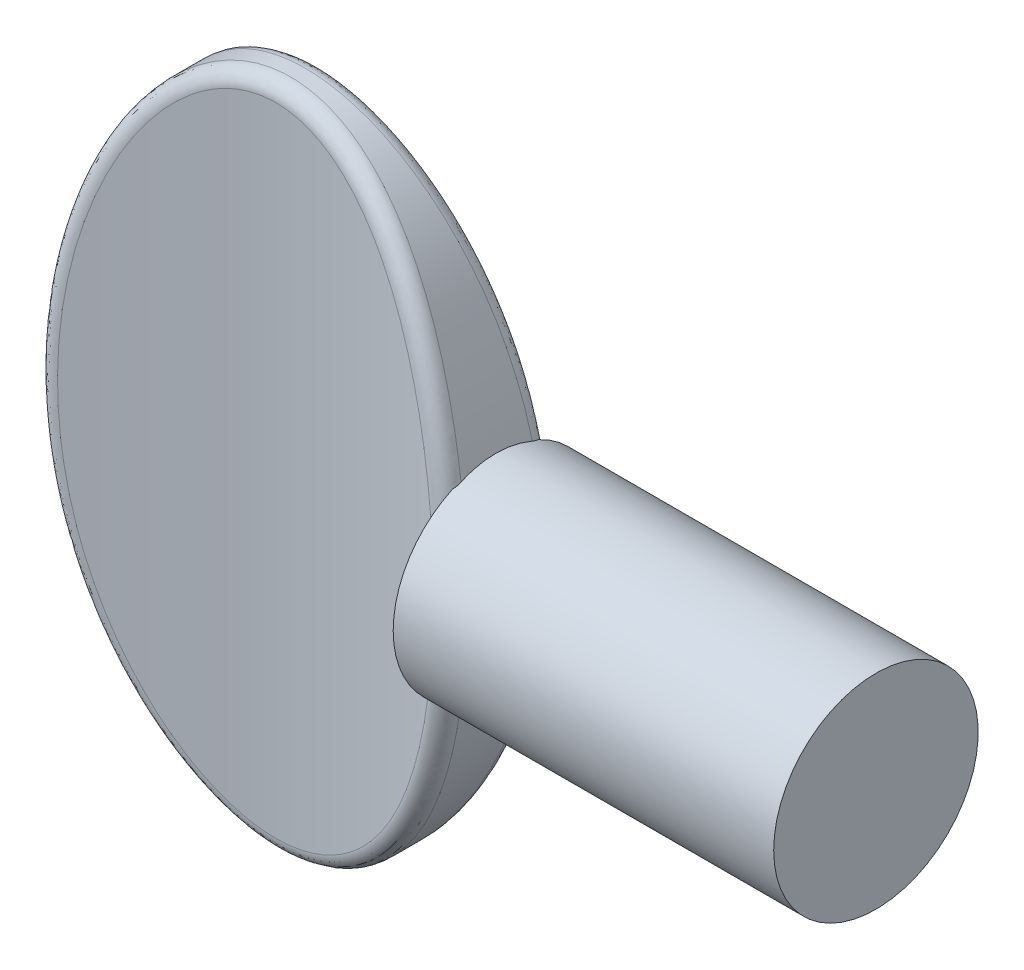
ISO-10303-21;
HEADER;
FILE_DESCRIPTION(('STEP AP214'),'2;1');
FILE_NAME('part.step','',(''),(''),'','','');
FILE_SCHEMA(('AUTOMOTIVE_DESIGN { 1 0 10303 214 1 1 1 1 }'));
ENDSEC;
DATA;
#1=APPLICATION_CONTEXT('core data for automotive mechanical design processes');
#2=APPLICATION_PROTOCOL_DEFINITION('international standard','automotive_design',2000,#1);
#3=PRODUCT_CONTEXT('',#1,'mechanical');
#4=PRODUCT('Part','Part','',(#3));
#5=PRODUCT_RELATED_PRODUCT_CATEGORY('part','',(#4));
#6=PRODUCT_DEFINITION_FORMATION('','',#4);
#7=PRODUCT_DEFINITION_CONTEXT('part definition',#1,'design');
#8=PRODUCT_DEFINITION('design','',#6,#7);
#9=PRODUCT_DEFINITION_SHAPE('','',#8);
#10=(LENGTH_UNIT() NAMED_UNIT(*) SI_UNIT(.MILLI.,.METRE.));
#11=(NAMED_UNIT(*) PLANE_ANGLE_UNIT() SI_UNIT($,.RADIAN.));
#12=(NAMED_UNIT(*) SI_UNIT($,.STERADIAN.) SOLID_ANGLE_UNIT());
#13=UNCERTAINTY_MEASURE_WITH_UNIT(LENGTH_MEASURE(1.E-05),#10,'distance_accuracy_value','');
#14=(GEOMETRIC_REPRESENTATION_CONTEXT(3) GLOBAL_UNCERTAINTY_ASSIGNED_CONTEXT((#13)) GLOBAL_UNIT_ASSIGNED_CONTEXT((#10,
#11,#12)) REPRESENTATION_CONTEXT('',''));
#15=CARTESIAN_POINT('',(0.,0.,0.));
#16=DIRECTION('',(0.,0.,1.));
#17=DIRECTION('',(1.,0.,0.));
#18=AXIS2_PLACEMENT_3D('',#15,#16,#17);
#19=CARTESIAN_POINT('',(0.,0.,1.016));
#20=DIRECTION('',(0.,0.,1.));
#21=DIRECTION('',(0.,-1.,0.));
#22=AXIS2_PLACEMENT_3D('',#19,#20,#21);
#23=ELLIPSE('',#22,5.715,3.556);
#24=DIRECTION('',(0.,0.,-1.));
#25=VECTOR('',#24,1.);
#26=SURFACE_OF_LINEAR_EXTRUSION('',#23,#25);
#27=CARTESIAN_POINT('',(3.41011531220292,-1.62014791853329,0.668376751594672));
#28=CARTESIAN_POINT('',(3.40671804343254,-1.63860905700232,0.623625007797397));
#29=CARTESIAN_POINT('',(3.40360222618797,-1.65521497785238,0.578110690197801));
#30=CARTESIAN_POINT('',(3.39801345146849,-1.68461510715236,0.485826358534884));
#31=CARTESIAN_POINT('',(3.39554052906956,-1.69740910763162,0.439056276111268));
#32=CARTESIAN_POINT('',(3.38920906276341,-1.72990576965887,0.297329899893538));
#33=CARTESIAN_POINT('',(3.38643361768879,-1.74374513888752,0.200903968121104));
#34=CARTESIAN_POINT('',(3.38412486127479,-1.75528275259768,0.00701645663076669));
#35=CARTESIAN_POINT('',(3.38459484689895,-1.75296458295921,-0.0904460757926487));
#36=CARTESIAN_POINT('',(3.38872446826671,-1.73223483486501,-0.283468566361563));
#37=CARTESIAN_POINT('',(3.39237835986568,-1.71385223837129,-0.379031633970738));
#38=CARTESIAN_POINT('',(3.39927526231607,-1.67798412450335,-0.507252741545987));
#39=CARTESIAN_POINT('',(3.40135032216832,-1.66710508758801,-0.541931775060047));
#40=CARTESIAN_POINT('',(3.40584397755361,-1.64323850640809,-0.610479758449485));
#41=CARTESIAN_POINT('',(3.4082620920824,-1.6302539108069,-0.64434976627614));
#42=CARTESIAN_POINT('',(3.41083461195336,-1.61623226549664,-0.677790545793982));
#43=B_SPLINE_CURVE_WITH_KNOTS('',3,(#27,#28,#29,#30,#31,#32,#33,#34,#35,#36,#37,#38,#39,#40,#41,
#42),.UNSPECIFIED.,.F.,.F.,(4,2,2,2,2,2,2,4),(0.,0.145499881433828,0.29100769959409,
0.581851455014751,0.872990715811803,1.16360581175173,1.2727648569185,1.381772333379),.UNSPECIFIED.);
#44=CARTESIAN_POINT('',(3.40596285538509,-1.64255427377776,0.611246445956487));
#45=VERTEX_POINT('',#44);
#46=CARTESIAN_POINT('',(3.40596285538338,-1.6425542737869,-0.611246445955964));
#47=VERTEX_POINT('',#46);
#48=EDGE_CURVE('E58',#45,#47,#43,.T.);
#49=ORIENTED_EDGE('',*,*,#48,.F.);
#50=CARTESIAN_POINT('',(2.87687361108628,2.44813994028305,0.791992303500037));
#51=CARTESIAN_POINT('',(3.18255529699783,2.5496565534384,0.881151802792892));
#52=CARTESIAN_POINT('',(3.19087427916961,2.52247577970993,0.548152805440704));
#53=CARTESIAN_POINT('',(2.94045219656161,2.23528015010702,0.810534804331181));
#54=CARTESIAN_POINT('',(3.25173180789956,2.32661822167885,0.903476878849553));
#55=CARTESIAN_POINT('',(3.25828081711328,2.30224582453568,0.567153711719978));
#56=CARTESIAN_POINT('',(2.99465455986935,2.01926969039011,0.826995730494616));
#57=CARTESIAN_POINT('',(3.31014106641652,2.10195664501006,0.923109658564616));
#58=CARTESIAN_POINT('',(3.31562682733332,2.07916028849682,0.584021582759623));
#59=CARTESIAN_POINT('',(3.08550522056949,1.5830552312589,0.85513976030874));
#60=CARTESIAN_POINT('',(3.40834569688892,1.6476446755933,0.956769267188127));
#61=CARTESIAN_POINT('',(3.41165763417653,1.62919353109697,0.61286138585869));
#62=CARTESIAN_POINT('',(3.12214641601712,1.36284957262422,0.866820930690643));
#63=CARTESIAN_POINT('',(3.4478175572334,1.41867397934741,0.970692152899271));
#64=CARTESIAN_POINT('',(3.45033488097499,1.40231081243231,0.624831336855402));
#65=CARTESIAN_POINT('',(3.17863710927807,0.919742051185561,0.885019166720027));
#66=CARTESIAN_POINT('',(3.50886358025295,0.957217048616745,0.992448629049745));
#67=CARTESIAN_POINT('',(3.50993638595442,0.946080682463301,0.643479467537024));
#68=CARTESIAN_POINT('',(3.19846897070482,0.696837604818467,0.891530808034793));
#69=CARTESIAN_POINT('',(3.53022382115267,0.725447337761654,1.00020785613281));
#70=CARTESIAN_POINT('',(3.53084199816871,0.716730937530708,0.650152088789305));
#71=CARTESIAN_POINT('',(3.22166889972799,0.250038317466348,0.89916161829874));
#72=CARTESIAN_POINT('',(3.55529121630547,0.260137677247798,1.00932947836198));
#73=CARTESIAN_POINT('',(3.55529615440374,0.257136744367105,0.657971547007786));
#74=CARTESIAN_POINT('',(3.22503654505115,0.0261434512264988,0.900280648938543));
#75=CARTESIAN_POINT('',(3.5589182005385,0.0273359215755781,1.0106627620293));
#76=CARTESIAN_POINT('',(3.55884425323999,0.0268922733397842,0.659118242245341));
#77=CARTESIAN_POINT('',(3.21529651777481,-0.424794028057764,0.897065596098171));
#78=CARTESIAN_POINT('',(3.54839475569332,-0.442282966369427,1.00681981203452));
#79=CARTESIAN_POINT('',(3.54857931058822,-0.436885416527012,0.655823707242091));
#80=CARTESIAN_POINT('',(3.20192627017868,-0.651830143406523,0.892644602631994));
#81=CARTESIAN_POINT('',(3.53399566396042,-0.678337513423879,1.00155250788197));
#82=CARTESIAN_POINT('',(3.53448957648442,-0.67041277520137,0.651293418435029));
#83=CARTESIAN_POINT('',(3.15798579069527,-1.10403389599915,0.878342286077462));
#84=CARTESIAN_POINT('',(3.48651511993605,-1.14926850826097,0.98445489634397));
#85=CARTESIAN_POINT('',(3.48815150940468,-1.13578713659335,0.636637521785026));
#86=CARTESIAN_POINT('',(3.12741141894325,-1.32920107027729,0.86845964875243));
#87=CARTESIAN_POINT('',(3.45358537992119,-1.38338047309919,0.972678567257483));
#88=CARTESIAN_POINT('',(3.45589880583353,-1.36763372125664,0.626510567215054));
#89=CARTESIAN_POINT('',(3.04849516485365,-1.77551295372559,0.843590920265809));
#90=CARTESIAN_POINT('',(3.36829281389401,-1.84818795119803,0.942941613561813));
#91=CARTESIAN_POINT('',(3.37255097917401,-1.82763853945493,0.601027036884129));
#92=CARTESIAN_POINT('',(3.00018846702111,-1.99666472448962,0.828614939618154));
#93=CARTESIAN_POINT('',(3.31625058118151,-2.07815631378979,0.925087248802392));
#94=CARTESIAN_POINT('',(3.32149316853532,-2.05580314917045,0.585680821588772));
#95=CARTESIAN_POINT('',(2.88476113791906,-2.43326023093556,0.79411239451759));
#96=CARTESIAN_POINT('',(3.19142384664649,-2.53294503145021,0.883801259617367));
#97=CARTESIAN_POINT('',(3.19926934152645,-2.50695447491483,0.550325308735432));
#98=CARTESIAN_POINT('',(2.81765268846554,-2.64870756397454,0.774588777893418));
#99=CARTESIAN_POINT('',(3.11906951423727,-2.75709243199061,0.860497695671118));
#100=CARTESIAN_POINT('',(3.12811634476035,-2.72994444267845,0.530319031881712));
#101=CARTESIAN_POINT('',(2.65311433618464,-3.0985151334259,0.729048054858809));
#102=CARTESIAN_POINT('',(2.94108253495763,-3.22556424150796,0.805967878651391));
#103=CARTESIAN_POINT('',(2.95319352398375,-3.19660978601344,0.483652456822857));
#104=CARTESIAN_POINT('',(2.55290441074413,-3.33177078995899,0.702519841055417));
#105=CARTESIAN_POINT('',(2.83297127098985,-3.46846636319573,0.774250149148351));
#106=CARTESIAN_POINT('',(2.84641629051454,-3.43928390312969,0.456468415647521));
#107=CARTESIAN_POINT('',(2.32320903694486,-3.78234312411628,0.64640489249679));
#108=CARTESIAN_POINT('',(2.58357223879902,-3.93908503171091,0.706749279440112));
#109=CARTESIAN_POINT('',(2.60051045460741,-3.91004049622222,0.398966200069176));
#110=CARTESIAN_POINT('',(2.19375678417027,-3.99967750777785,0.616821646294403));
#111=CARTESIAN_POINT('',(2.44340804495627,-4.16619911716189,0.671174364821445));
#112=CARTESIAN_POINT('',(2.4614185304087,-4.138139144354,0.368651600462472));
#113=CARTESIAN_POINT('',(1.94091533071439,-4.3535976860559,0.565411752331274));
#114=CARTESIAN_POINT('',(2.16660546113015,-4.53837771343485,0.608745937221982));
#115=CARTESIAN_POINT('',(2.18768136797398,-4.51205711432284,0.315970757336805));
#116=CARTESIAN_POINT('',(1.82542698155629,-4.49608375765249,0.543660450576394));
#117=CARTESIAN_POINT('',(2.04053515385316,-4.68812354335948,0.582339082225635));
#118=CARTESIAN_POINT('',(2.06208689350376,-4.66339853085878,0.29368172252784));
#119=CARTESIAN_POINT('',(1.57466794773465,-4.76186582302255,0.501591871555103));
#120=CARTESIAN_POINT('',(1.76506012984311,-4.96825132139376,0.530990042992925));
#121=CARTESIAN_POINT('',(1.78731476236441,-4.94761823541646,0.250573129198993));
#122=CARTESIAN_POINT('',(1.43943196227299,-4.88519470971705,0.481272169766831));
#123=CARTESIAN_POINT('',(1.61619495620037,-5.09885836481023,0.506044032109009));
#124=CARTESIAN_POINT('',(1.63817843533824,-5.08052812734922,0.229751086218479));
#125=CARTESIAN_POINT('',(1.1911972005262,-5.07171066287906,0.449763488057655));
#126=CARTESIAN_POINT('',(1.340429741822,-5.29730303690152,0.467084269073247));
#127=CARTESIAN_POINT('',(1.36169787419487,-5.28324603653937,0.197463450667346));
#128=CARTESIAN_POINT('',(1.08336860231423,-5.14191532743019,0.437647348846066));
#129=CARTESIAN_POINT('',(1.22051144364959,-5.3722217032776,0.452038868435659));
#130=CARTESIAN_POINT('',(1.24085897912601,-5.36011289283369,0.185047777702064));
#131=CARTESIAN_POINT('',(0.858050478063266,-5.26424468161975,0.416270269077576));
#132=CARTESIAN_POINT('',(0.968834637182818,-5.50292549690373,0.42542157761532));
#133=CARTESIAN_POINT('',(0.986440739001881,-5.49490642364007,0.163142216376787));
#134=CARTESIAN_POINT('',(0.740575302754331,-5.31639564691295,0.407005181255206));
#135=CARTESIAN_POINT('',(0.836995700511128,-5.5590377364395,0.413787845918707));
#136=CARTESIAN_POINT('',(0.85288027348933,-5.55286061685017,0.153648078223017));
#137=CARTESIAN_POINT('',(0.515993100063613,-5.39221579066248,0.393443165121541));
#138=CARTESIAN_POINT('',(0.584104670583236,-5.64060692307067,0.396743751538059));
#139=CARTESIAN_POINT('',(0.595858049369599,-5.63753360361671,0.139750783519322));
#140=CARTESIAN_POINT('',(0.409913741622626,-5.41895204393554,0.38861490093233));
#141=CARTESIAN_POINT('',(0.464186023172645,-5.66954672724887,0.390631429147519));
#142=CARTESIAN_POINT('',(0.473813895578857,-5.66759942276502,0.134803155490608));
#143=CARTESIAN_POINT('',(0.194791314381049,-5.45394261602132,0.382284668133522));
#144=CARTESIAN_POINT('',(0.220889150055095,-5.70732589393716,0.382635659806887));
#145=CARTESIAN_POINT('',(0.225513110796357,-5.70700859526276,0.128316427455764));
#146=CARTESIAN_POINT('',(0.0857502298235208,-5.46220901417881,0.380780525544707));
#147=CARTESIAN_POINT('',(0.0971189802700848,-5.71630681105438,0.380722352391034));
#148=CARTESIAN_POINT('',(0.0992592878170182,-5.71636549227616,0.126775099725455));
#149=CARTESIAN_POINT('',(-0.132181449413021,-5.45950203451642,0.381271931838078));
#150=CARTESIAN_POINT('',(-0.149751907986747,-5.71338033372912,0.381344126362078));
#151=CARTESIAN_POINT('',(-0.15300824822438,-5.71330808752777,0.127278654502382));
#152=CARTESIAN_POINT('',(-0.24107184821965,-5.44851292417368,0.383270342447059));
#153=CARTESIAN_POINT('',(-0.27330895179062,-5.70144504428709,0.383885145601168));
#154=CARTESIAN_POINT('',(-0.27902168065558,-5.70087598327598,0.129326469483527));
#155=CARTESIAN_POINT('',(-0.455477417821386,-5.40829096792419,0.390538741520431));
#156=CARTESIAN_POINT('',(-0.515669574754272,-5.65803605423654,0.393060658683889));
#157=CARTESIAN_POINT('',(-0.526267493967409,-5.65561592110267,0.136774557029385));
#158=CARTESIAN_POINT('',(-0.560990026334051,-5.37904460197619,0.395811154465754));
#159=CARTESIAN_POINT('',(-0.634846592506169,-5.62640367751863,0.399728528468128));
#160=CARTESIAN_POINT('',(-0.647496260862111,-5.62277284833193,0.142177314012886));
#161=CARTESIAN_POINT('',(-0.791362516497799,-5.29549090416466,0.410722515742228));
#162=CARTESIAN_POINT('',(-0.894095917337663,-5.53655861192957,0.418454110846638));
#163=CARTESIAN_POINT('',(-0.910741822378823,-5.52960626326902,0.157457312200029));
#164=CARTESIAN_POINT('',(-0.914651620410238,-5.23680665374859,0.421113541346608));
#165=CARTESIAN_POINT('',(-1.03227791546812,-5.4734725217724,0.431484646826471));
#166=CARTESIAN_POINT('',(-1.05060182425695,-5.46452941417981,0.168105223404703));
#167=CARTESIAN_POINT('',(-1.1501410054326,-5.1000145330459,0.444888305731));
#168=CARTESIAN_POINT('',(-1.29493907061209,-5.32749236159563,0.461037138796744));
#169=CARTESIAN_POINT('',(-1.31582055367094,-5.31418719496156,0.192467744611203));
#170=CARTESIAN_POINT('',(-1.26232097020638,-5.02187196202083,0.458277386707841));
#171=CARTESIAN_POINT('',(-1.41945940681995,-5.24422211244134,0.477628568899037));
#172=CARTESIAN_POINT('',(-1.44115278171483,-5.22888577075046,0.20618782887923));
#173=CARTESIAN_POINT('',(-1.52425358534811,-4.81141848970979,0.493480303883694));
#174=CARTESIAN_POINT('',(-1.71006807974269,-5.02053132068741,0.521084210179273));
#175=CARTESIAN_POINT('',(-1.73197783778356,-5.00086686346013,0.242261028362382));
#176=CARTESIAN_POINT('',(-1.66743267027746,-4.67075761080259,0.516329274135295));
#177=CARTESIAN_POINT('',(-1.86727379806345,-4.87182691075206,0.549058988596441));
#178=CARTESIAN_POINT('',(-1.88928718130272,-4.84982635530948,0.265674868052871));
#179=CARTESIAN_POINT('',(-1.93076565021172,-4.36861808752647,0.56315778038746));
#180=CARTESIAN_POINT('',(-2.15601250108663,-4.55386893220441,0.606083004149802));
#181=CARTESIAN_POINT('',(-2.17678970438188,-4.52789876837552,0.313661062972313));
#182=CARTESIAN_POINT('',(-2.05086652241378,-4.20709289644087,0.587139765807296));
#183=CARTESIAN_POINT('',(-2.28680032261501,-4.38442619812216,0.63511216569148));
#184=CARTESIAN_POINT('',(-2.30692049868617,-4.35696740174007,0.338235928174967));
#185=CARTESIAN_POINT('',(-2.24774440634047,-3.90468381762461,0.629494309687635));
#186=CARTESIAN_POINT('',(-2.50094051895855,-4.06830128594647,0.686196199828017));
#187=CARTESIAN_POINT('',(-2.51931723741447,-4.03858337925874,0.38163755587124));
#188=CARTESIAN_POINT('',(-2.32835126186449,-3.7663893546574,0.648005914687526));
#189=CARTESIAN_POINT('',(-2.58844569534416,-3.92375543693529,0.708482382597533));
#190=CARTESIAN_POINT('',(-2.60592272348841,-3.89353451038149,0.400606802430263));
#191=CARTESIAN_POINT('',(-2.47764655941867,-3.48301662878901,0.68392178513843));
#192=CARTESIAN_POINT('',(-2.750598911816,-3.62773016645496,0.751698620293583));
#193=CARTESIAN_POINT('',(-2.76590357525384,-3.59720408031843,0.437410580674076));
#194=CARTESIAN_POINT('',(-2.54632812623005,-3.33793451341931,0.701325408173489));
#195=CARTESIAN_POINT('',(-2.82495665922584,-3.4763903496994,0.772577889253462));
#196=CARTESIAN_POINT('',(-2.83927131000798,-3.44591898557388,0.455244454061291));
#197=CARTESIAN_POINT('',(-2.73596214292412,-2.89487609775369,0.751105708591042));
#198=CARTESIAN_POINT('',(-3.03164049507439,-3.01174573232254,0.832642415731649));
#199=CARTESIAN_POINT('',(-3.04146428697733,-2.98492820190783,0.506255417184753));
#200=CARTESIAN_POINT('',(-2.84046694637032,-2.58914736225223,0.781043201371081));
#201=CARTESIAN_POINT('',(-3.1439027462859,-2.69404108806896,0.868280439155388));
#202=CARTESIAN_POINT('',(-3.15233965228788,-2.66814963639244,0.53693302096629));
#203=CARTESIAN_POINT('',(-3.02361670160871,-1.91917408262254,0.835455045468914));
#204=CARTESIAN_POINT('',(-3.34221273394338,-1.99525212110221,0.933484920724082));
#205=CARTESIAN_POINT('',(-3.34632626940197,-1.97562309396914,0.592690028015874));
#206=CARTESIAN_POINT('',(-3.09598835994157,-1.55305613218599,0.858425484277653));
#207=CARTESIAN_POINT('',(-3.41971506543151,-1.61558535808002,0.960711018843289));
#208=CARTESIAN_POINT('',(-3.42273238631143,-1.59818444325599,0.616228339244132));
#209=CARTESIAN_POINT('',(-3.19389380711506,-0.813438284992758,0.889906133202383));
#210=CARTESIAN_POINT('',(-3.52551559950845,-0.845326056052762,0.998352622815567));
#211=CARTESIAN_POINT('',(-3.52603668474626,-0.836598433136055,0.648487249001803));
#212=CARTESIAN_POINT('',(-3.219394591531,-0.439933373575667,0.898406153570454));
#213=CARTESIAN_POINT('',(-3.55284253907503,-0.458062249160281,1.00842962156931));
#214=CARTESIAN_POINT('',(-3.55289998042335,-0.452446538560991,0.657197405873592));
#215=CARTESIAN_POINT('',(-3.22377462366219,0.165515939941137,0.899871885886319));
#216=CARTESIAN_POINT('',(-3.55753925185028,0.172415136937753,1.01016840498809));
#217=CARTESIAN_POINT('',(-3.55751322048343,0.170223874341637,0.658699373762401));
#218=CARTESIAN_POINT('',(-3.21666132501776,0.397456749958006,0.897504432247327));
#219=CARTESIAN_POINT('',(-3.54988979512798,0.413553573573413,1.00735185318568));
#220=CARTESIAN_POINT('',(-3.55001934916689,0.408752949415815,0.656273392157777));
#221=CARTESIAN_POINT('',(-3.18467556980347,0.860036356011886,0.887014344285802));
#222=CARTESIAN_POINT('',(-3.51533559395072,0.895293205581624,0.994814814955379));
#223=CARTESIAN_POINT('',(-3.5162998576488,0.884649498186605,0.645523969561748));
#224=CARTESIAN_POINT('',(-3.15979714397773,1.09067468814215,0.878889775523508));
#225=CARTESIAN_POINT('',(-3.48854259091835,1.1350753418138,0.9851346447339));
#226=CARTESIAN_POINT('',(-3.49006794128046,1.12201655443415,0.637198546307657));
#227=CARTESIAN_POINT('',(-3.09177046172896,1.54865418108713,0.857163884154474));
#228=CARTESIAN_POINT('',(-3.41502593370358,1.61202494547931,0.959158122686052));
#229=CARTESIAN_POINT('',(-3.41826670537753,1.59374884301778,0.614935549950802));
#230=CARTESIAN_POINT('',(-3.04863796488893,1.77599801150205,0.843567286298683));
#231=CARTESIAN_POINT('',(-3.36857207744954,1.84840189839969,0.942954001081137));
#232=CARTESIAN_POINT('',(-3.37271406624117,1.82811648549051,0.601002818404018));
#233=CARTESIAN_POINT('',(-2.94317111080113,2.22543485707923,0.811418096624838));
#234=CARTESIAN_POINT('',(-3.25454291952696,2.31651004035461,0.904496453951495));
#235=CARTESIAN_POINT('',(-3.26114490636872,2.29208476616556,0.568058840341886));
#236=CARTESIAN_POINT('',(-2.88084877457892,2.44753106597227,0.792868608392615));
#237=CARTESIAN_POINT('',(-3.18737593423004,2.54750357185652,0.882369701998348));
#238=CARTESIAN_POINT('',(-3.1951411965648,2.52168829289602,0.549050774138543));
#239=CARTESIAN_POINT('',(-2.72296807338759,2.92171701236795,0.747996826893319));
#240=CARTESIAN_POINT('',(-3.01671846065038,3.04112688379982,0.828682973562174));
#241=CARTESIAN_POINT('',(-3.02753524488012,3.01295829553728,0.503069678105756));
#242=CARTESIAN_POINT('',(-2.62354531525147,3.17242818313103,0.720887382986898));
#243=CARTESIAN_POINT('',(-2.9095837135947,3.3020505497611,0.796309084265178));
#244=CARTESIAN_POINT('',(-2.92177195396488,3.27338041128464,0.475290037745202));
#245=CARTESIAN_POINT('',(-2.45047373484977,3.53592668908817,0.677330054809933));
#246=CARTESIAN_POINT('',(-2.72089131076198,3.68328686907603,0.743720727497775));
#247=CARTESIAN_POINT('',(-2.73679732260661,3.65249750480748,0.430655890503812));
#248=CARTESIAN_POINT('',(-2.38881716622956,3.6549621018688,0.662334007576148));
#249=CARTESIAN_POINT('',(-2.65403373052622,3.80757139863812,0.725698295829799));
#250=CARTESIAN_POINT('',(-2.6707761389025,3.77691258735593,0.415289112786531));
#251=CARTESIAN_POINT('',(-2.25689122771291,3.88780573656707,0.631713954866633));
#252=CARTESIAN_POINT('',(-2.51060863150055,4.0509787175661,0.688809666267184));
#253=CARTESIAN_POINT('',(-2.52910566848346,4.02092289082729,0.383912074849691));
#254=CARTESIAN_POINT('',(-2.18662455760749,4.00161558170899,0.616090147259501));
#255=CARTESIAN_POINT('',(-2.43421779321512,4.17003284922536,0.669971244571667));
#256=CARTESIAN_POINT('',(-2.45345939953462,4.14051960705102,0.367902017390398));
#257=CARTESIAN_POINT('',(-2.00630311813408,4.26762511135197,0.578214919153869));
#258=CARTESIAN_POINT('',(-2.23805461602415,4.4481030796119,0.624273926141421));
#259=CARTESIAN_POINT('',(-2.25863520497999,4.42099703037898,0.329090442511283));
#260=CARTESIAN_POINT('',(-1.89168515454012,4.4166251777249,0.555850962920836));
#261=CARTESIAN_POINT('',(-2.11309442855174,4.60451461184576,0.597170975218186));
#262=CARTESIAN_POINT('',(-2.1342612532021,4.57889839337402,0.306173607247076));
#263=CARTESIAN_POINT('',(-1.64204982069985,4.69578543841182,0.512276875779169));
#264=CARTESIAN_POINT('',(-1.83921681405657,4.89842163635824,0.544072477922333));
#265=CARTESIAN_POINT('',(-1.86139526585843,4.87668575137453,0.261522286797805));
#266=CARTESIAN_POINT('',(-1.50706569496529,4.82597567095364,0.491064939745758));
#267=CARTESIAN_POINT('',(-1.69088789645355,5.03609559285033,0.518086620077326));
#268=CARTESIAN_POINT('',(-1.71294250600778,5.01660042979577,0.239785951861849));
#269=CARTESIAN_POINT('',(-1.25822257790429,5.02460380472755,0.457805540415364));
#270=CARTESIAN_POINT('',(-1.41485811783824,5.24717231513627,0.477035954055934));
#271=CARTESIAN_POINT('',(-1.43656618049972,5.23187493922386,0.205704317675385));
#272=CARTESIAN_POINT('',(-1.14977220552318,5.09995591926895,0.444894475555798));
#273=CARTESIAN_POINT('',(-1.29446557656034,5.32746078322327,0.461038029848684));
#274=CARTESIAN_POINT('',(-1.3153835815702,5.31413478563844,0.192474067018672));
#275=CARTESIAN_POINT('',(-0.922470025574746,5.23252776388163,0.421861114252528));
#276=CARTESIAN_POINT('',(-1.04096461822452,5.4689251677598,0.432410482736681));
#277=CARTESIAN_POINT('',(-1.0594278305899,5.45981518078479,0.16887127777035));
#278=CARTESIAN_POINT('',(-0.80363402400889,5.28977445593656,0.41173467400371));
#279=CARTESIAN_POINT('',(-0.907817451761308,5.53043531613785,0.419719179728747));
#280=CARTESIAN_POINT('',(-0.924675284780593,5.5232637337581,0.158494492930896));
#281=CARTESIAN_POINT('',(-0.577455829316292,5.37398354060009,0.39672020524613));
#282=CARTESIAN_POINT('',(-0.653408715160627,5.62094693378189,0.40087394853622));
#283=CARTESIAN_POINT('',(-0.666376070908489,5.6171058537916,0.143108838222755));
#284=CARTESIAN_POINT('',(-0.471370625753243,5.4043497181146,0.391249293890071));
#285=CARTESIAN_POINT('',(-0.5336224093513,5.65378212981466,0.393957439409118));
#286=CARTESIAN_POINT('',(-0.544550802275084,5.65118930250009,0.13750267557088));
#287=CARTESIAN_POINT('',(-0.255633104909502,5.44661210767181,0.38361532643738));
#288=CARTESIAN_POINT('',(-0.289803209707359,5.69938537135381,0.384322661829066));
#289=CARTESIAN_POINT('',(-0.295851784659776,5.69872932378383,0.129679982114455));
#290=CARTESIAN_POINT('',(-0.145983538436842,5.45852223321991,0.38144977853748));
#291=CARTESIAN_POINT('',(-0.165395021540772,5.71232072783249,0.381569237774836));
#292=CARTESIAN_POINT('',(-0.168981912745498,5.71220143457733,0.127460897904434));
#293=CARTESIAN_POINT('',(0.0738869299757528,5.46278107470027,0.380676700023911));
#294=CARTESIAN_POINT('',(0.0836678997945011,5.7169249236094,0.380591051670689));
#295=CARTESIAN_POINT('',(0.0855232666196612,5.71701154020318,0.126668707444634));
#296=CARTESIAN_POINT('',(0.184108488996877,5.45509623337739,0.382075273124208));
#297=CARTESIAN_POINT('',(0.208792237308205,5.70857455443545,0.382370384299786));
#298=CARTESIAN_POINT('',(0.21315951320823,5.70831156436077,0.128101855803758));
#299=CARTESIAN_POINT('',(0.401619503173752,5.42083768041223,0.38827437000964));
#300=CARTESIAN_POINT('',(0.454815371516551,5.67158273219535,0.390201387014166));
#301=CARTESIAN_POINT('',(0.464261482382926,5.66972014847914,0.134454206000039));
#302=CARTESIAN_POINT('',(0.50890688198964,5.3942509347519,0.393077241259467));
#303=CARTESIAN_POINT('',(0.576122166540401,5.64279808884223,0.39628327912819));
#304=CARTESIAN_POINT('',(0.587724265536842,5.63981408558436,0.13937581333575));
#305=CARTESIAN_POINT('',(0.739415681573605,5.31719606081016,0.40686416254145));
#306=CARTESIAN_POINT('',(0.83573942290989,5.55988553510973,0.41361366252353));
#307=CARTESIAN_POINT('',(0.851580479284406,5.55374603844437,0.153503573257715));
#308=CARTESIAN_POINT('',(0.861383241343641,5.26294420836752,0.416504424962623));
#309=CARTESIAN_POINT('',(0.972626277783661,5.50149772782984,0.425721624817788));
#310=CARTESIAN_POINT('',(0.990242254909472,5.49345262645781,0.163382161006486));
#311=CARTESIAN_POINT('',(1.0949077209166,5.13510542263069,0.438830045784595));
#312=CARTESIAN_POINT('',(1.23342883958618,5.36492676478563,0.453514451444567));
#313=CARTESIAN_POINT('',(1.2538468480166,5.35263149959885,0.186259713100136));
#314=CARTESIAN_POINT('',(1.20644657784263,5.06148575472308,0.451520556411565));
#315=CARTESIAN_POINT('',(1.35742533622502,5.28637625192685,0.469268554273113));
#316=CARTESIAN_POINT('',(1.37876592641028,5.2720695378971,0.199263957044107));
#317=CARTESIAN_POINT('',(1.46573802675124,4.86335533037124,0.484912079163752));
#318=CARTESIAN_POINT('',(1.64542638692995,5.0755944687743,0.510545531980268));
#319=CARTESIAN_POINT('',(1.66733639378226,5.05689690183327,0.233480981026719));
#320=CARTESIAN_POINT('',(1.60745261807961,4.73079185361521,0.506661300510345));
#321=CARTESIAN_POINT('',(1.80127145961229,4.93527393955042,0.537224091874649));
#322=CARTESIAN_POINT('',(1.82341116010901,4.914206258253,0.255767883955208));
#323=CARTESIAN_POINT('',(1.86900175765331,4.44495554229,0.551550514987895));
#324=CARTESIAN_POINT('',(2.08839377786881,4.63419132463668,0.591965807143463));
#325=CARTESIAN_POINT('',(2.10960205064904,4.60897313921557,0.301766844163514));
#326=CARTESIAN_POINT('',(1.98878809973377,4.29163833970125,0.574693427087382));
#327=CARTESIAN_POINT('',(2.21900804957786,4.47319746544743,0.620024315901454));
#328=CARTESIAN_POINT('',(2.23966103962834,4.44638820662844,0.32548189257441));
#329=CARTESIAN_POINT('',(2.18584389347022,4.00402857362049,0.615817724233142));
#330=CARTESIAN_POINT('',(2.43354527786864,4.17232015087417,0.669684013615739));
#331=CARTESIAN_POINT('',(2.45265033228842,4.14301394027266,0.367622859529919));
#332=CARTESIAN_POINT('',(2.26678612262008,3.87233883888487,0.633878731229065));
#333=CARTESIAN_POINT('',(2.52149542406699,4.03457978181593,0.691453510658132));
#334=CARTESIAN_POINT('',(2.5397676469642,4.00465027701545,0.386130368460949));
#335=CARTESIAN_POINT('',(2.4172945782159,3.60212171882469,0.669113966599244));
#336=CARTESIAN_POINT('',(2.68508948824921,3.75215155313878,0.733890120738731));
#337=CARTESIAN_POINT('',(2.70131013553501,3.72162071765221,0.422236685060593));
#338=CARTESIAN_POINT('',(2.48685442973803,3.463590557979,0.686287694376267));
#339=CARTESIAN_POINT('',(2.76046142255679,3.60757416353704,0.754513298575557));
#340=CARTESIAN_POINT('',(2.77572819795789,3.57695134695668,0.439834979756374));
#341=CARTESIAN_POINT('',(2.61551558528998,3.18118784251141,0.71926816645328));
#342=CARTESIAN_POINT('',(2.89998706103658,3.31289252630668,0.794118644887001));
#343=CARTESIAN_POINT('',(2.91309166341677,3.28272006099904,0.473630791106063));
#344=CARTESIAN_POINT('',(2.6746042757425,3.03731009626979,0.73507325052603));
#345=CARTESIAN_POINT('',(2.96389868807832,3.16294480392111,0.813050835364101));
#346=CARTESIAN_POINT('',(2.97602323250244,3.13315249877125,0.489826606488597));
#347=CARTESIAN_POINT('',(2.78296275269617,2.74552013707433,0.764925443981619));
#348=CARTESIAN_POINT('',(3.08122852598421,2.85877616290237,0.84882953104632));
#349=CARTESIAN_POINT('',(3.09125015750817,2.83035190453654,0.520416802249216));
#350=CARTESIAN_POINT('',(2.83222971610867,2.59760677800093,0.778972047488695));
#351=CARTESIAN_POINT('',(3.13445317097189,2.70474702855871,0.865627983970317));
#352=CARTESIAN_POINT('',(3.14354245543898,2.67711783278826,0.534810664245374));
#353=CARTESIAN_POINT('',(2.87687361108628,2.44813994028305,0.791992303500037));
#354=CARTESIAN_POINT('',(3.18255529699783,2.5496565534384,0.881151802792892));
#355=CARTESIAN_POINT('',(3.19087427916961,2.52247577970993,0.548152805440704));
#356=(BOUNDED_SURFACE() B_SPLINE_SURFACE(3,2,((#50,#51,#52),(#53,#54,#55),(#56,#57,#58),(#59,
#60,#61),(#62,#63,#64),(#65,#66,#67),(#68,#69,#70),(#71,#72,#73),(#74,#75,#76),(#77,#78,#79),
(#80,#81,#82),(#83,#84,#85),(#86,#87,#88),(#89,#90,#91),(#92,#93,#94),(#95,#96,#97),(#98,#99,
#100),(#101,#102,#103),(#104,#105,#106),(#107,#108,#109),(#110,#111,#112),(#113,#114,#115),
(#116,#117,#118),(#119,#120,#121),(#122,#123,#124),(#125,#126,#127),(#128,#129,#130),(#131,#132,
#133),(#134,#135,#136),(#137,#138,#139),(#140,#141,#142),(#143,#144,#145),(#146,#147,#148),
(#149,#150,#151),(#152,#153,#154),(#155,#156,#157),(#158,#159,#160),(#161,#162,#163),(#164,#165,
#166),(#167,#168,#169),(#170,#171,#172),(#173,#174,#175),(#176,#177,#178),(#179,#180,#181),
(#182,#183,#184),(#185,#186,#187),(#188,#189,#190),(#191,#192,#193),(#194,#195,#196),(#197,#198,
#199),(#200,#201,#202),(#203,#204,#205),(#206,#207,#208),(#209,#210,#211),(#212,#213,#214),
(#215,#216,#217),(#218,#219,#220),(#221,#222,#223),(#224,#225,#226),(#227,#228,#229),(#230,#231,
#232),(#233,#234,#235),(#236,#237,#238),(#239,#240,#241),(#242,#243,#244),(#245,#246,#247),
(#248,#249,#250),(#251,#252,#253),(#254,#255,#256),(#257,#258,#259),(#260,#261,#262),(#263,#264,
#265),(#266,#267,#268),(#269,#270,#271),(#272,#273,#274),(#275,#276,#277),(#278,#279,#280),
(#281,#282,#283),(#284,#285,#286),(#287,#288,#289),(#290,#291,#292),(#293,#294,#295),(#296,#297,
#298),(#299,#300,#301),(#302,#303,#304),(#305,#306,#307),(#308,#309,#310),(#311,#312,#313),
(#314,#315,#316),(#317,#318,#319),(#320,#321,#322),(#323,#324,#325),(#326,#327,#328),(#329,#330,
#331),(#332,#333,#334),(#335,#336,#337),(#338,#339,#340),(#341,#342,#343),(#344,#345,#346),
(#347,#348,#349),(#350,#351,#352),(#353,#354,#355)),.UNSPECIFIED.,.T.,.F.,
.F.) B_SPLINE_SURFACE_WITH_KNOTS((4,2,2,2,2,2,2,2,2,2,2,2,2,2,2,2,2,2,2,2,2,2,2,2,2,2,2,2,2,2,2,
2,2,2,2,2,2,2,2,2,2,2,2,2,2,2,2,2,2,2,4),(3,3),(0.,0.670088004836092,1.34044677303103,
2.01150801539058,2.68258646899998,3.36432560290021,4.04622885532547,4.72678632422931,
5.40690386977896,6.17399274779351,6.94021517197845,7.49835151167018,8.05551867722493,
8.44869733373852,8.84130132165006,9.17597761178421,9.51043495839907,9.8451656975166,
10.1801446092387,10.5969595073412,11.0145231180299,11.6249253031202,12.2367135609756,
12.7226461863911,13.2088580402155,14.1814928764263,15.3007522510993,16.4207994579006,
17.116313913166,17.8120621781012,18.5072109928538,19.2019252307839,20.0156340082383,
20.4222285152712,20.8286958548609,21.4003838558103,21.9711485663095,22.3745805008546,
22.7774087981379,23.1149751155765,23.4522868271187,23.7901765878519,24.1282995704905,
24.5358772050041,24.9441481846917,25.5345239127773,26.1261823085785,26.5957484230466,
27.0655766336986,27.5359670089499,28.0064923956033),(0.,1.),
.UNSPECIFIED.) GEOMETRIC_REPRESENTATION_ITEM() RATIONAL_B_SPLINE_SURFACE(((1.,0.605083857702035,
1.),(1.,0.601611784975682,1.),(1.,0.5986115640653,1.),(1.,0.59355041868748,1.),(1.,
0.591489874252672,1.),(1.,0.588302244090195,1.),(1.,0.587176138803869,1.),(1.,0.585858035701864,
1.),(1.,0.585666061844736,1.),(1.,0.586220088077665,1.),(1.,0.586981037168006,1.),(1.,
0.589468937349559,1.),(1.,0.591196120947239,1.),(1.,0.59561711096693,1.),(1.,0.598309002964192,
1.),(1.,0.60466419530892,1.),(1.,0.6083268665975,1.),(1.,0.617156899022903,1.),(1.,
0.622456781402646,1.),(1.,0.634262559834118,1.),(1.,0.640767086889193,1.),(1.,0.652862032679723,
1.),(1.,0.658220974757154,1.),(1.,0.669205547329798,1.),(1.,0.674830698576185,1.),(1.,
0.684105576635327,1.),(1.,0.687849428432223,1.),(1.,0.69472599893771,1.),(1.,0.697859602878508,
1.),(1.,0.702576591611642,1.),(1.,0.704320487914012,1.),(1.,0.70662574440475,1.),(1.,
0.707187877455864,1.),(1.,0.707006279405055,1.),(1.,0.706261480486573,1.),(1.,0.70362723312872,
1.),(1.,0.701736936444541,1.),(1.,0.696594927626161,1.),(1.,0.693123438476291,1.),(1.,
0.685596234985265,1.),(1.,0.681539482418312,1.),(1.,0.671400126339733,1.),(1.,0.665247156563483,
1.),(1.,0.653377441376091,1.),(1.,0.647661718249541,1.),(1.,0.638021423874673,1.),(1.,
0.633970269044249,1.),(1.,0.626341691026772,1.),(1.,0.622764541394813,1.),(1.,0.612770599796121,
1.),(1.,0.607093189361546,1.),(1.,0.597028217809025,1.),(1.,0.592964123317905,1.),(1.,
0.587442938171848,1.),(1.,0.585987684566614,1.),(1.,0.585737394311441,1.),(1.,0.586143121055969,
1.),(1.,0.587958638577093,1.),(1.,0.589368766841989,1.),(1.,0.593196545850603,1.),(1.,
0.595613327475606,1.),(1.,0.601457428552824,1.),(1.,0.604884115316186,1.),(1.,0.613433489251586,
1.),(1.,0.618746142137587,1.),(1.,0.627733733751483,1.),(1.,0.630898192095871,1.),(1.,
0.6375502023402,1.),(1.,0.641037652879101,1.),(1.,0.649782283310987,1.),(1.,0.655182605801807,
1.),(1.,0.666333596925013,1.),(1.,0.672083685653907,1.),(1.,0.681684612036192,1.),(1.,
0.685598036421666,1.),(1.,0.692883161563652,1.),(1.,0.69625566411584,1.),(1.,0.701416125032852,
1.),(1.,0.703372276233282,1.),(1.,0.706134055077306,1.),(1.,0.706940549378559,1.),(1.,
0.707226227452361,1.),(1.,0.70670313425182,1.),(1.,0.704443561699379,1.),(1.,0.702706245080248,
1.),(1.,0.69790604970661,1.),(1.,0.694644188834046,1.),(1.,0.687475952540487,1.),(1.,
0.683568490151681,1.),(1.,0.673792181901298,1.),(1.,0.667825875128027,1.),(1.,0.65623775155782,
1.),(1.,0.650616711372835,1.),(1.,0.64108568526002,1.),(1.,0.637061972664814,1.),(1.,
0.629448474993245,1.),(1.,0.625858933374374,1.),(1.,0.619133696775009,1.),(1.,0.615998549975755,
1.),(1.,0.610192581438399,1.),(1.,0.607521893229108,1.),(1.,0.605083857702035,1.))) REPRESENTATION_ITEM('') SURFACE());
#357=CARTESIAN_POINT('',(3.19087427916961,2.52247577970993,0.548152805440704));
#358=CARTESIAN_POINT('',(3.25828081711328,2.30224582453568,0.567153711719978));
#359=CARTESIAN_POINT('',(3.31562682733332,2.07916028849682,0.584021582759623));
#360=CARTESIAN_POINT('',(3.41165763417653,1.62919353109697,0.61286138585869));
#361=CARTESIAN_POINT('',(3.45033488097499,1.40231081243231,0.624831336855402));
#362=CARTESIAN_POINT('',(3.50993638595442,0.946080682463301,0.643479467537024));
#363=CARTESIAN_POINT('',(3.5308419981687,0.716730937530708,0.650152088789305));
#364=CARTESIAN_POINT('',(3.55529615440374,0.257136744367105,0.657971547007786));
#365=CARTESIAN_POINT('',(3.55884425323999,0.0268922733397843,0.659118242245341));
#366=CARTESIAN_POINT('',(3.54857931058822,-0.436885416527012,0.655823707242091));
#367=CARTESIAN_POINT('',(3.53448957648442,-0.67041277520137,0.651293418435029));
#368=CARTESIAN_POINT('',(3.48815150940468,-1.13578713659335,0.636637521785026));
#369=CARTESIAN_POINT('',(3.45589880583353,-1.36763372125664,0.626510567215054));
#370=CARTESIAN_POINT('',(3.37255097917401,-1.82763853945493,0.601027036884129));
#371=CARTESIAN_POINT('',(3.32149316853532,-2.05580314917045,0.585680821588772));
#372=CARTESIAN_POINT('',(3.19926934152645,-2.50695447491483,0.550325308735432));
#373=CARTESIAN_POINT('',(3.12811634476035,-2.72994444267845,0.530319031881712));
#374=CARTESIAN_POINT('',(2.95319352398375,-3.19660978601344,0.483652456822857));
#375=CARTESIAN_POINT('',(2.84641629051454,-3.43928390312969,0.456468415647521));
#376=CARTESIAN_POINT('',(2.60051045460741,-3.91004049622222,0.398966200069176));
#377=CARTESIAN_POINT('',(2.4614185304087,-4.138139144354,0.368651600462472));
#378=CARTESIAN_POINT('',(2.18768136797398,-4.51205711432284,0.315970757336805));
#379=CARTESIAN_POINT('',(2.06208689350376,-4.66339853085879,0.29368172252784));
#380=CARTESIAN_POINT('',(1.78731476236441,-4.94761823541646,0.250573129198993));
#381=CARTESIAN_POINT('',(1.63817843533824,-5.08052812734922,0.229751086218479));
#382=CARTESIAN_POINT('',(1.36169787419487,-5.28324603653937,0.197463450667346));
#383=CARTESIAN_POINT('',(1.24085897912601,-5.36011289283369,0.185047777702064));
#384=CARTESIAN_POINT('',(0.986440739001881,-5.49490642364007,0.163142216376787));
#385=CARTESIAN_POINT('',(0.852880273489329,-5.55286061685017,0.153648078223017));
#386=CARTESIAN_POINT('',(0.595858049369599,-5.63753360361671,0.139750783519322));
#387=CARTESIAN_POINT('',(0.473813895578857,-5.66759942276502,0.134803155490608));
#388=CARTESIAN_POINT('',(0.225513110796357,-5.70700859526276,0.128316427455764));
#389=CARTESIAN_POINT('',(0.0992592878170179,-5.71636549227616,0.126775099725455));
#390=CARTESIAN_POINT('',(-0.15300824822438,-5.71330808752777,0.127278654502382));
#391=CARTESIAN_POINT('',(-0.279021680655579,-5.70087598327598,0.129326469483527));
#392=CARTESIAN_POINT('',(-0.526267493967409,-5.65561592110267,0.136774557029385));
#393=CARTESIAN_POINT('',(-0.647496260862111,-5.62277284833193,0.142177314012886));
#394=CARTESIAN_POINT('',(-0.910741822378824,-5.52960626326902,0.157457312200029));
#395=CARTESIAN_POINT('',(-1.05060182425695,-5.46452941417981,0.168105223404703));
#396=CARTESIAN_POINT('',(-1.31582055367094,-5.31418719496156,0.192467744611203));
#397=CARTESIAN_POINT('',(-1.44115278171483,-5.22888577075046,0.20618782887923));
#398=CARTESIAN_POINT('',(-1.73197783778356,-5.00086686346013,0.242261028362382));
#399=CARTESIAN_POINT('',(-1.88928718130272,-4.84982635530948,0.265674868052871));
#400=CARTESIAN_POINT('',(-2.17678970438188,-4.52789876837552,0.313661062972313));
#401=CARTESIAN_POINT('',(-2.30692049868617,-4.35696740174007,0.338235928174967));
#402=CARTESIAN_POINT('',(-2.51931723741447,-4.03858337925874,0.38163755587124));
#403=CARTESIAN_POINT('',(-2.60592272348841,-3.89353451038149,0.400606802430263));
#404=CARTESIAN_POINT('',(-2.76590357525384,-3.59720408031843,0.437410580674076));
#405=CARTESIAN_POINT('',(-2.83927131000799,-3.44591898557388,0.455244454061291));
#406=CARTESIAN_POINT('',(-3.04146428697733,-2.98492820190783,0.506255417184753));
#407=CARTESIAN_POINT('',(-3.15233965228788,-2.66814963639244,0.53693302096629));
#408=CARTESIAN_POINT('',(-3.34632626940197,-1.97562309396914,0.592690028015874));
#409=CARTESIAN_POINT('',(-3.42273238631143,-1.59818444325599,0.616228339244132));
#410=CARTESIAN_POINT('',(-3.52603668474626,-0.836598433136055,0.648487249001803));
#411=CARTESIAN_POINT('',(-3.55289998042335,-0.45244653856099,0.657197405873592));
#412=CARTESIAN_POINT('',(-3.55751322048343,0.170223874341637,0.658699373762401));
#413=CARTESIAN_POINT('',(-3.55001934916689,0.408752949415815,0.656273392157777));
#414=CARTESIAN_POINT('',(-3.5162998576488,0.884649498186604,0.645523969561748));
#415=CARTESIAN_POINT('',(-3.49006794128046,1.12201655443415,0.637198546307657));
#416=CARTESIAN_POINT('',(-3.41826670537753,1.59374884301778,0.614935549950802));
#417=CARTESIAN_POINT('',(-3.37271406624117,1.82811648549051,0.601002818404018));
#418=CARTESIAN_POINT('',(-3.26114490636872,2.29208476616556,0.568058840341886));
#419=CARTESIAN_POINT('',(-3.1951411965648,2.52168829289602,0.549050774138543));
#420=CARTESIAN_POINT('',(-3.02753524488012,3.01295829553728,0.503069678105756));
#421=CARTESIAN_POINT('',(-2.92177195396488,3.27338041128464,0.475290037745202));
#422=CARTESIAN_POINT('',(-2.73679732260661,3.65249750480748,0.430655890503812));
#423=CARTESIAN_POINT('',(-2.6707761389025,3.77691258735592,0.415289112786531));
#424=CARTESIAN_POINT('',(-2.52910566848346,4.02092289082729,0.383912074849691));
#425=CARTESIAN_POINT('',(-2.45345939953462,4.14051960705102,0.367902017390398));
#426=CARTESIAN_POINT('',(-2.25863520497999,4.42099703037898,0.329090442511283));
#427=CARTESIAN_POINT('',(-2.1342612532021,4.57889839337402,0.306173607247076));
#428=CARTESIAN_POINT('',(-1.86139526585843,4.87668575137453,0.261522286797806));
#429=CARTESIAN_POINT('',(-1.71294250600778,5.01660042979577,0.239785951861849));
#430=CARTESIAN_POINT('',(-1.43656618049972,5.23187493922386,0.205704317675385));
#431=CARTESIAN_POINT('',(-1.3153835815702,5.31413478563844,0.192474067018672));
#432=CARTESIAN_POINT('',(-1.0594278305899,5.45981518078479,0.16887127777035));
#433=CARTESIAN_POINT('',(-0.924675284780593,5.5232637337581,0.158494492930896));
#434=CARTESIAN_POINT('',(-0.66637607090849,5.6171058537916,0.143108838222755));
#435=CARTESIAN_POINT('',(-0.544550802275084,5.65118930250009,0.13750267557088));
#436=CARTESIAN_POINT('',(-0.295851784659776,5.69872932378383,0.129679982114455));
#437=CARTESIAN_POINT('',(-0.168981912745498,5.71220143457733,0.127460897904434));
#438=CARTESIAN_POINT('',(0.085523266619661,5.71701154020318,0.126668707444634));
#439=CARTESIAN_POINT('',(0.21315951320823,5.70831156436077,0.128101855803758));
#440=CARTESIAN_POINT('',(0.464261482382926,5.66972014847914,0.134454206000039));
#441=CARTESIAN_POINT('',(0.587724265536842,5.63981408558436,0.13937581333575));
#442=CARTESIAN_POINT('',(0.851580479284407,5.55374603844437,0.153503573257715));
#443=CARTESIAN_POINT('',(0.990242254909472,5.49345262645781,0.163382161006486));
#444=CARTESIAN_POINT('',(1.2538468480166,5.35263149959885,0.186259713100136));
#445=CARTESIAN_POINT('',(1.37876592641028,5.2720695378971,0.199263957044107));
#446=CARTESIAN_POINT('',(1.66733639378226,5.05689690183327,0.233480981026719));
#447=CARTESIAN_POINT('',(1.82341116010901,4.914206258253,0.255767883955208));
#448=CARTESIAN_POINT('',(2.10960205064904,4.60897313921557,0.301766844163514));
#449=CARTESIAN_POINT('',(2.23966103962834,4.44638820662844,0.32548189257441));
#450=CARTESIAN_POINT('',(2.45265033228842,4.14301394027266,0.367622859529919));
#451=CARTESIAN_POINT('',(2.5397676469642,4.00465027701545,0.386130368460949));
#452=CARTESIAN_POINT('',(2.70131013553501,3.72162071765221,0.422236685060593));
#453=CARTESIAN_POINT('',(2.77572819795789,3.57695134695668,0.439834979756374));
#454=CARTESIAN_POINT('',(2.91309166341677,3.28272006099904,0.473630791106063));
#455=CARTESIAN_POINT('',(2.97602323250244,3.13315249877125,0.489826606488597));
#456=CARTESIAN_POINT('',(3.09125015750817,2.83035190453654,0.520416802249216));
#457=CARTESIAN_POINT('',(3.14354245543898,2.67711783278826,0.534810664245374));
#458=CARTESIAN_POINT('',(3.19087427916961,2.52247577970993,0.548152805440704));
#459=B_SPLINE_CURVE_WITH_KNOTS('',3,(#357,#358,#359,#360,#361,#362,#363,#364,#365,#366,#367,
#368,#369,#370,#371,#372,#373,#374,#375,#376,#377,#378,#379,#380,#381,#382,#383,#384,#385,#386,
#387,#388,#389,#390,#391,#392,#393,#394,#395,#396,#397,#398,#399,#400,#401,#402,#403,#404,#405,
#406,#407,#408,#409,#410,#411,#412,#413,#414,#415,#416,#417,#418,#419,#420,#421,#422,#423,#424,
#425,#426,#427,#428,#429,#430,#431,#432,#433,#434,#435,#436,#437,#438,#439,#440,#441,#442,#443,
#444,#445,#446,#447,#448,#449,#450,#451,#452,#453,#454,#455,#456,#457,#458),.UNSPECIFIED.,.T.,
.F.,(4,2,2,2,2,2,2,2,2,2,2,2,2,2,2,2,2,2,2,2,2,2,2,2,2,2,2,2,2,2,2,2,2,2,2,2,2,2,2,2,2,2,2,2,2,
2,2,2,2,2,4),(0.,0.670088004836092,1.34044677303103,2.01150801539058,2.68258646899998,
3.36432560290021,4.04622885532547,4.72678632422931,5.40690386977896,6.17399274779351,
6.94021517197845,7.49835151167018,8.05551867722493,8.44869733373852,8.84130132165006,
9.17597761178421,9.51043495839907,9.8451656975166,10.1801446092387,10.5969595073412,
11.0145231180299,11.6249253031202,12.2367135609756,12.7226461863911,13.2088580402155,
14.1814928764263,15.3007522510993,16.4207994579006,17.116313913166,17.8120621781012,
18.5072109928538,19.2019252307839,20.0156340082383,20.4222285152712,20.8286958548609,
21.4003838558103,21.9711485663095,22.3745805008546,22.7774087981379,23.1149751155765,
23.4522868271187,23.7901765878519,24.1282995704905,24.5358772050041,24.9441481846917,
25.5345239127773,26.1261823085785,26.5957484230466,27.0655766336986,27.5359670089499,
28.0064923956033),.UNSPECIFIED.);
#460=CARTESIAN_POINT('',(3.40596285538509,1.64255427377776,0.61124644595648));
#461=VERTEX_POINT('',#460);
#462=EDGE_CURVE('E244',#45,#461,#459,.T.);
#463=ORIENTED_EDGE('',*,*,#462,.T.);
#464=CARTESIAN_POINT('',(3.41083461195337,1.61623226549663,-0.677790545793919));
#465=CARTESIAN_POINT('',(3.40739829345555,1.63495502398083,-0.633143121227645));
#466=CARTESIAN_POINT('',(3.40423995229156,1.65182673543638,-0.587722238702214));
#467=CARTESIAN_POINT('',(3.39856043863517,1.68176523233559,-0.495602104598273));
#468=CARTESIAN_POINT('',(3.39603930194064,1.69483180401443,-0.448902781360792));
#469=CARTESIAN_POINT('',(3.38955654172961,1.72815399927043,-0.307351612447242));
#470=CARTESIAN_POINT('',(3.38667145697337,1.74255372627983,-0.210994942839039));
#471=CARTESIAN_POINT('',(3.38413914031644,1.75521385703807,-0.0171476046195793));
#472=CARTESIAN_POINT('',(3.38449523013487,1.75345770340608,0.0803441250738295));
#473=CARTESIAN_POINT('',(3.38840701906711,1.73383459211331,0.273519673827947));
#474=CARTESIAN_POINT('',(3.3919569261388,1.71599679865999,0.369206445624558));
#475=CARTESIAN_POINT('',(3.39872396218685,1.68086475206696,0.497621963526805));
#476=CARTESIAN_POINT('',(3.40076333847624,1.67019367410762,0.532334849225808));
#477=CARTESIAN_POINT('',(3.4051885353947,1.64674169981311,0.600964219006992));
#478=CARTESIAN_POINT('',(3.40757387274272,1.63396374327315,0.634881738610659));
#479=CARTESIAN_POINT('',(3.41011531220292,1.62014791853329,0.668376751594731));
#480=B_SPLINE_CURVE_WITH_KNOTS('',3,(#464,#465,#466,#467,#468,#469,#470,#471,#472,#473,#474,
#475,#476,#477,#478,#479),.UNSPECIFIED.,.F.,.F.,(4,2,2,2,2,2,2,4),(0.,0.145520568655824,
0.291049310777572,0.581940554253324,0.873129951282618,1.16379233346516,1.27285754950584,
1.38177185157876),.UNSPECIFIED.);
#481=CARTESIAN_POINT('',(3.40596285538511,1.64255427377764,-0.611246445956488));
#482=VERTEX_POINT('',#481);
#483=EDGE_CURVE('E108',#482,#461,#480,.T.);
#484=ORIENTED_EDGE('',*,*,#483,.F.);
#485=CARTESIAN_POINT('',(-0.123092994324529,-5.45693709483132,-0.381737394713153));
#486=CARTESIAN_POINT('',(-0.13943752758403,-5.71060677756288,-0.381933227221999));
#487=CARTESIAN_POINT('',(-0.142470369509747,-5.71041133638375,-0.127755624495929));
#488=CARTESIAN_POINT('',(-0.011454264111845,-5.46430737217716,-0.380400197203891));
#489=CARTESIAN_POINT('',(-0.0130964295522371,-5.71856718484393,-0.380242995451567));
#490=CARTESIAN_POINT('',(-0.0133036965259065,-5.71873172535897,-0.126385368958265));
#491=CARTESIAN_POINT('',(0.100854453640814,-5.46159545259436,-0.380894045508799));
#492=CARTESIAN_POINT('',(0.114452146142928,-5.71561905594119,-0.380871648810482));
#493=CARTESIAN_POINT('',(0.116820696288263,-5.71565965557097,-0.126891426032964));
#494=CARTESIAN_POINT('',(0.323240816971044,-5.43627548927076,-0.385482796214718));
#495=CARTESIAN_POINT('',(0.366166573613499,-5.68826377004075,-0.386672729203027));
#496=CARTESIAN_POINT('',(0.373878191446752,-5.68710200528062,-0.131593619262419));
#497=CARTESIAN_POINT('',(0.433317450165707,-5.41365861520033,-0.38957929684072));
#498=CARTESIAN_POINT('',(0.49079226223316,-5.66374469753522,-0.39186886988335));
#499=CARTESIAN_POINT('',(0.500809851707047,-5.66160647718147,-0.135791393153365));
#500=CARTESIAN_POINT('',(0.644091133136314,-5.35179132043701,-0.40068524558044));
#501=CARTESIAN_POINT('',(0.728336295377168,-5.59714727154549,-0.405840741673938));
#502=CARTESIAN_POINT('',(0.742644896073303,-5.59233995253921,-0.147171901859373));
#503=CARTESIAN_POINT('',(0.744985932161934,-5.31321078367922,-0.407577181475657));
#504=CARTESIAN_POINT('',(0.841822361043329,-5.55558459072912,-0.41451166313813));
#505=CARTESIAN_POINT('',(0.857822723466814,-5.54930591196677,-0.154234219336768));
#506=CARTESIAN_POINT('',(0.9403389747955,-5.22213621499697,-0.42365168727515));
#507=CARTESIAN_POINT('',(1.06066491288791,-5.45803154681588,-0.434596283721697));
#508=CARTESIAN_POINT('',(1.07955626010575,-5.44842640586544,-0.170706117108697));
#509=CARTESIAN_POINT('',(1.03479463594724,-5.16963664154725,-0.432835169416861));
#510=CARTESIAN_POINT('',(1.1661362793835,-5.40184295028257,-0.446048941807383));
#511=CARTESIAN_POINT('',(1.18610851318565,-5.39057504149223,-0.180116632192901));
#512=CARTESIAN_POINT('',(1.271676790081,-5.01803561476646,-0.458944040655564));
#513=CARTESIAN_POINT('',(1.4304329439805,-5.23995428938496,-0.478496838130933));
#514=CARTESIAN_POINT('',(1.4518319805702,-5.22462942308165,-0.20687096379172));
#515=CARTESIAN_POINT('',(1.40849087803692,-4.90997192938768,-0.477188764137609));
#516=CARTESIAN_POINT('',(1.58171111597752,-5.12506482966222,-0.501021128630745));
#517=CARTESIAN_POINT('',(1.60376597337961,-5.10733165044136,-0.225566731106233));
#518=CARTESIAN_POINT('',(1.66378977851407,-4.67333881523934,-0.515782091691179));
#519=CARTESIAN_POINT('',(1.86315917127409,-4.87496295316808,-0.54832742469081));
#520=CARTESIAN_POINT('',(1.88530186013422,-4.85266962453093,-0.265114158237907));
#521=CARTESIAN_POINT('',(1.78222013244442,-4.54471066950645,-0.536136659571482));
#522=CARTESIAN_POINT('',(1.9928843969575,-4.73940152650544,-0.573145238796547));
#523=CARTESIAN_POINT('',(2.01483752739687,-4.71524800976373,-0.285971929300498));
#524=CARTESIAN_POINT('',(1.97815175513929,-4.30254854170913,-0.572850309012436));
#525=CARTESIAN_POINT('',(2.20694456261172,-4.48537708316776,-0.617672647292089));
#526=CARTESIAN_POINT('',(2.22804741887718,-4.45808078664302,-0.323593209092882));
#527=CARTESIAN_POINT('',(2.05896619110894,-4.19176350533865,-0.589121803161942));
#528=CARTESIAN_POINT('',(2.29506608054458,-4.36919303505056,-0.637371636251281));
#529=CARTESIAN_POINT('',(2.31558209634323,-4.34093695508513,-0.340266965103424));
#530=CARTESIAN_POINT('',(2.21088759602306,-3.96334326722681,-0.62139584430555));
#531=CARTESIAN_POINT('',(2.46065656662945,-4.12994044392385,-0.676381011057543));
#532=CARTESIAN_POINT('',(2.47960893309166,-4.10026432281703,-0.373338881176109));
#533=CARTESIAN_POINT('',(2.2819891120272,-3.84570427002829,-0.637398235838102));
#534=CARTESIAN_POINT('',(2.53791362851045,-4.00690623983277,-0.695667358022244));
#535=CARTESIAN_POINT('',(2.55609489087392,-3.97673198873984,-0.389736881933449));
#536=CARTESIAN_POINT('',(2.48197516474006,-3.48456914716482,-0.684342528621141));
#537=CARTESIAN_POINT('',(2.75646049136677,-3.62745984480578,-0.752504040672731));
#538=CARTESIAN_POINT('',(2.77071120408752,-3.59853940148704,-0.437841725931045));
#539=CARTESIAN_POINT('',(2.59741295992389,-3.23302117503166,-0.714195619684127));
#540=CARTESIAN_POINT('',(2.88095109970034,-3.36542811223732,-0.788209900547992));
#541=CARTESIAN_POINT('',(2.89386126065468,-3.33645974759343,-0.468432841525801));
#542=CARTESIAN_POINT('',(2.77202139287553,-2.78115350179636,-0.761715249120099));
#543=CARTESIAN_POINT('',(3.06963853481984,-2.89528218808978,-0.845064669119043));
#544=CARTESIAN_POINT('',(3.07965353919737,-2.86722244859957,-0.517127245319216));
#545=CARTESIAN_POINT('',(2.83804619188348,-2.58361547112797,-0.780567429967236));
#546=CARTESIAN_POINT('',(3.14088339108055,-2.68969572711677,-0.867584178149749));
#547=CARTESIAN_POINT('',(3.14972736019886,-2.66257848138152,-0.536445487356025));
#548=CARTESIAN_POINT('',(2.95375739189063,-2.18312492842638,-0.814557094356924));
#549=CARTESIAN_POINT('',(3.26604892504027,-2.27247815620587,-0.90826686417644));
#550=CARTESIAN_POINT('',(3.27236120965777,-2.24837318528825,-0.571275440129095));
#551=CARTESIAN_POINT('',(3.00343598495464,-1.98016987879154,-0.829692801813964));
#552=CARTESIAN_POINT('',(3.319603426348,-2.06136105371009,-0.926325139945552));
#553=CARTESIAN_POINT('',(3.32491286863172,-2.03880955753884,-0.58678533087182));
#554=CARTESIAN_POINT('',(3.0873734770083,-1.57060867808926,-0.855744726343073));
#555=CARTESIAN_POINT('',(3.4103345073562,-1.63481064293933,-0.957482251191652));
#556=CARTESIAN_POINT('',(3.41362808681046,-1.61637526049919,-0.613481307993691));
#557=CARTESIAN_POINT('',(3.12162556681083,-1.36400095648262,-0.866659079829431));
#558=CARTESIAN_POINT('',(3.44724682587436,-1.4199400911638,-0.970495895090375));
#559=CARTESIAN_POINT('',(3.44978440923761,-1.40350317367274,-0.624665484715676));
#560=CARTESIAN_POINT('',(3.17532031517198,-0.948490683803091,-0.883945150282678));
#561=CARTESIAN_POINT('',(3.50527124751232,-0.987224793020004,-0.991161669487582));
#562=CARTESIAN_POINT('',(3.50643781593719,-0.975674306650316,-0.642378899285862));
#563=CARTESIAN_POINT('',(3.19475610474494,-0.739587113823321,-0.890314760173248));
#564=CARTESIAN_POINT('',(3.52621293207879,-0.769971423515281,-0.998754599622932));
#565=CARTESIAN_POINT('',(3.52692763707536,-0.760716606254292,-0.648905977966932));
#566=CARTESIAN_POINT('',(3.21946612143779,-0.315050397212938,-0.898432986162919));
#567=CARTESIAN_POINT('',(3.55291391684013,-0.327833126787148,-1.00845949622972));
#568=CARTESIAN_POINT('',(3.55297488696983,-0.324001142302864,-0.657224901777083));
#569=CARTESIAN_POINT('',(3.22433680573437,-0.0993899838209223,-0.900049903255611));
#570=CARTESIAN_POINT('',(3.55816108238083,-0.103567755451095,-1.01038645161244));
#571=CARTESIAN_POINT('',(3.55810681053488,-0.102218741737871,-0.658881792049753));
#572=CARTESIAN_POINT('',(3.21886534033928,0.331615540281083,-0.898243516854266));
#573=CARTESIAN_POINT('',(3.55224851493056,0.345296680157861,-1.00822707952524));
#574=CARTESIAN_POINT('',(3.55234044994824,0.341049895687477,-0.657030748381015));
#575=CARTESIAN_POINT('',(3.20852926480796,0.546960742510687,-0.894822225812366));
#576=CARTESIAN_POINT('',(3.54111275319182,0.569232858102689,-1.00414952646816));
#577=CARTESIAN_POINT('',(3.54144856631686,0.562536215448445,-0.653524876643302));
#578=CARTESIAN_POINT('',(3.17246927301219,0.97612716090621,-0.883040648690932));
#579=CARTESIAN_POINT('',(3.5021505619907,1.01617613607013,-0.990065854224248));
#580=CARTESIAN_POINT('',(3.50342777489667,1.00412831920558,-0.64145203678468));
#581=CARTESIAN_POINT('',(3.14674900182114,1.18994872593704,-0.874681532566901));
#582=CARTESIAN_POINT('',(3.47444316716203,1.23852947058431,-0.980102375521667));
#583=CARTESIAN_POINT('',(3.47630271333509,1.22423441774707,-0.632886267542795));
#584=CARTESIAN_POINT('',(3.0794608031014,1.61460140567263,-0.853291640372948));
#585=CARTESIAN_POINT('',(3.4017152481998,1.68076462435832,-0.954526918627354));
#586=CARTESIAN_POINT('',(3.40526412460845,1.66173141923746,-0.610967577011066));
#587=CARTESIAN_POINT('',(3.03789740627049,1.82543335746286,-0.840262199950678));
#588=CARTESIAN_POINT('',(3.3569155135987,1.90001742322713,-0.938989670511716));
#589=CARTESIAN_POINT('',(3.3613553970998,1.87912308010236,-0.597616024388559));
#590=CARTESIAN_POINT('',(2.91311756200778,2.34720251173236,-0.802312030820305));
#591=CARTESIAN_POINT('',(3.22235162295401,2.44224905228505,-0.893698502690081));
#592=CARTESIAN_POINT('',(3.22934609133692,2.41783626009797,-0.558727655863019));
#593=CARTESIAN_POINT('',(2.81946544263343,2.65548937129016,-0.77470296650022));
#594=CARTESIAN_POINT('',(3.12176418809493,2.76249199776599,-0.860850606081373));
#595=CARTESIAN_POINT('',(3.1301267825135,2.73677993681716,-0.530436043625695));
#596=CARTESIAN_POINT('',(2.64764037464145,3.1043371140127,-0.72783087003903));
#597=CARTESIAN_POINT('',(2.9347084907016,3.23277417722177,-0.804372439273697));
#598=CARTESIAN_POINT('',(2.94731028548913,3.20280572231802,-0.482405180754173));
#599=CARTESIAN_POINT('',(2.5851698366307,3.25163716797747,-0.711304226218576));
#600=CARTESIAN_POINT('',(2.86713943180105,3.38631524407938,-0.784572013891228));
#601=CARTESIAN_POINT('',(2.88073784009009,3.35602817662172,-0.46546996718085));
#602=CARTESIAN_POINT('',(2.4489079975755,3.54043343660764,-0.676870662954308));
#603=CARTESIAN_POINT('',(2.71932543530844,3.6877401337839,-0.743205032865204));
#604=CARTESIAN_POINT('',(2.73514069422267,3.6571669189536,-0.43018514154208));
#605=CARTESIAN_POINT('',(2.37512187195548,3.6819322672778,-0.658964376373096));
#606=CARTESIAN_POINT('',(2.63934221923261,3.8354577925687,-0.721690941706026));
#607=CARTESIAN_POINT('',(2.65612168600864,3.8050855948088,-0.411836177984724));
#608=CARTESIAN_POINT('',(2.19437337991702,3.99327918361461,-0.617535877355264));
#609=CARTESIAN_POINT('',(2.44309350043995,4.16049159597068,-0.671837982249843));
#610=CARTESIAN_POINT('',(2.46187832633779,4.13161203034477,-0.369383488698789));
#611=CARTESIAN_POINT('',(2.08377530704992,4.16091390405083,-0.593765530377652));
#612=CARTESIAN_POINT('',(2.32293179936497,4.3359709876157,-0.643159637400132));
#613=CARTESIAN_POINT('',(2.34258431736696,4.3081803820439,-0.345025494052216));
#614=CARTESIAN_POINT('',(1.84061113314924,4.47870447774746,-0.54645636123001));
#615=CARTESIAN_POINT('',(2.05711535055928,4.66959778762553,-0.585766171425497));
#616=CARTESIAN_POINT('',(2.07860016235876,4.64487073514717,-0.296546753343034));
#617=CARTESIAN_POINT('',(1.70807500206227,4.6288837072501,-0.52291726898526));
#618=CARTESIAN_POINT('',(1.91217182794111,4.82776591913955,-0.557103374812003));
#619=CARTESIAN_POINT('',(1.93394464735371,4.80501469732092,-0.272425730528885));
#620=CARTESIAN_POINT('',(1.45884004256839,4.86525628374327,-0.48454808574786));
#621=CARTESIAN_POINT('',(1.63693611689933,5.07804219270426,-0.510001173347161));
#622=CARTESIAN_POINT('',(1.65939935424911,5.05910257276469,-0.233107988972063));
#623=CARTESIAN_POINT('',(1.34788838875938,4.95766234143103,-0.469109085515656));
#624=CARTESIAN_POINT('',(1.51441904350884,5.17606602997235,-0.490992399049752));
#625=CARTESIAN_POINT('',(1.53647871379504,5.15910996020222,-0.21728730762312));
#626=CARTESIAN_POINT('',(1.11311526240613,5.1239704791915,-0.440794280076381));
#627=CARTESIAN_POINT('',(1.25379532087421,5.35284836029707,-0.455992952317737));
#628=CARTESIAN_POINT('',(1.2742841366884,5.34036261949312,-0.188272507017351));
#629=CARTESIAN_POINT('',(0.989314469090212,5.19790165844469,-0.427914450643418));
#630=CARTESIAN_POINT('',(1.11578921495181,5.43195150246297,-0.439945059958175));
#631=CARTESIAN_POINT('',(1.13503643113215,5.42163738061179,-0.175074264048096));
#632=CARTESIAN_POINT('',(0.757053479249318,5.30853976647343,-0.408411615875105));
#633=CARTESIAN_POINT('',(0.855441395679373,5.55053009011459,-0.415566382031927));
#634=CARTESIAN_POINT('',(0.871593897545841,5.54409448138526,-0.155089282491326));
#635=CARTESIAN_POINT('',(0.650732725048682,5.34978611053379,-0.401045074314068));
#636=CARTESIAN_POINT('',(0.735858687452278,5.59497680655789,-0.406295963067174));
#637=CARTESIAN_POINT('',(0.750261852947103,5.59009523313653,-0.147540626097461));
#638=CARTESIAN_POINT('',(0.432756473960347,5.4138783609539,-0.389539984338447));
#639=CARTESIAN_POINT('',(0.490170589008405,5.66397934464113,-0.391819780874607));
#640=CARTESIAN_POINT('',(0.500169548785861,5.66185215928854,-0.135751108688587));
#641=CARTESIAN_POINT('',(0.321106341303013,5.43674237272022,-0.385398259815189));
#642=CARTESIAN_POINT('',(0.363753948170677,5.68876870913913,-0.386565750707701));
#643=CARTESIAN_POINT('',(0.371416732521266,5.6876282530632,-0.131506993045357));
#644=CARTESIAN_POINT('',(0.0953016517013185,5.46199617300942,-0.380821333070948));
#645=CARTESIAN_POINT('',(0.108166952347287,5.71605187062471,-0.380779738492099));
#646=CARTESIAN_POINT('',(0.110395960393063,5.71611212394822,-0.126816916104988));
#647=CARTESIAN_POINT('',(-0.0188568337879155,5.46435115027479,-0.38039243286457));
#648=CARTESIAN_POINT('',(-0.0214930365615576,5.71861334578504,-0.38023340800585));
#649=CARTESIAN_POINT('',(-0.0218775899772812,5.71878067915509,-0.126377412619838));
#650=CARTESIAN_POINT('',(-0.24572137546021,5.44826308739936,-0.383310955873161));
#651=CARTESIAN_POINT('',(-0.278407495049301,5.7012247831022,-0.383925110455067));
#652=CARTESIAN_POINT('',(-0.284342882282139,5.70061940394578,-0.129368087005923));
#653=CARTESIAN_POINT('',(-0.35842676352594,5.42981080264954,-0.386660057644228));
#654=CARTESIAN_POINT('',(-0.406166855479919,5.68119585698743,-0.388179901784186));
#655=CARTESIAN_POINT('',(-0.414533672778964,5.67977912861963,-0.132799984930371));
#656=CARTESIAN_POINT('',(-0.59839885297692,5.36893400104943,-0.397619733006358));
#657=CARTESIAN_POINT('',(-0.677070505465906,5.61556509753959,-0.401993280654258));
#658=CARTESIAN_POINT('',(-0.690438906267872,5.611482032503,-0.144030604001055));
#659=CARTESIAN_POINT('',(-0.724748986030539,5.32287018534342,-0.405875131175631));
#660=CARTESIAN_POINT('',(-0.819383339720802,5.56582000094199,-0.412408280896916));
#661=CARTESIAN_POINT('',(-0.834866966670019,5.55999533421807,-0.152490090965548));
#662=CARTESIAN_POINT('',(-0.967547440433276,5.20921915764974,-0.425928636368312));
#663=CARTESIAN_POINT('',(-1.09137434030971,5.44409909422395,-0.437460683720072));
#664=CARTESIAN_POINT('',(-1.11042431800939,5.43412892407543,-0.173039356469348));
#665=CARTESIAN_POINT('',(-1.08397581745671,5.14158983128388,-0.437733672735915));
#666=CARTESIAN_POINT('',(-1.22124609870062,5.37171111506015,-0.452178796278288));
#667=CARTESIAN_POINT('',(-1.2415269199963,5.35970442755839,-0.185136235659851));
#668=CARTESIAN_POINT('',(-1.34396703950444,4.96352978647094,-0.468171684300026));
#669=CARTESIAN_POINT('',(-1.51064859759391,5.18196010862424,-0.489907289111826));
#670=CARTESIAN_POINT('',(-1.53232028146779,5.16536272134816,-0.216326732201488));
#671=CARTESIAN_POINT('',(-1.48299342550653,4.84638510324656,-0.48775420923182));
#672=CARTESIAN_POINT('',(-1.66405056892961,5.05762544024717,-0.514023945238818));
#673=CARTESIAN_POINT('',(-1.68622299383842,5.0386133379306,-0.236393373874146));
#674=CARTESIAN_POINT('',(-1.74125556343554,4.5915016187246,-0.528778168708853));
#675=CARTESIAN_POINT('',(-1.94829352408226,4.78859438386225,-0.564209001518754));
#676=CARTESIAN_POINT('',(-1.97017308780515,4.76513091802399,-0.278431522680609));
#677=CARTESIAN_POINT('',(-1.86045486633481,4.4537257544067,-0.550222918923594));
#678=CARTESIAN_POINT('',(-2.07862990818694,4.64359833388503,-0.590298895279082));
#679=CARTESIAN_POINT('',(-2.100176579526,4.61836196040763,-0.300406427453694));
#680=CARTESIAN_POINT('',(-2.05726542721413,4.19474007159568,-0.588688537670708));
#681=CARTESIAN_POINT('',(-2.29335194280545,4.37222414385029,-0.636870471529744));
#682=CARTESIAN_POINT('',(-2.31377602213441,4.34405687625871,-0.339822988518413));
#683=CARTESIAN_POINT('',(-2.13833187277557,4.07622992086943,-0.605681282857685));
#684=CARTESIAN_POINT('',(-2.38162437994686,4.24807240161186,-0.657406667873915));
#685=CARTESIAN_POINT('',(-2.40136341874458,4.21905977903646,-0.357235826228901));
#686=CARTESIAN_POINT('',(-2.29013149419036,3.83235535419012,-0.639184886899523));
#687=CARTESIAN_POINT('',(-2.54689259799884,3.99285514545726,-0.697843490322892));
#688=CARTESIAN_POINT('',(-2.56487356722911,3.96270770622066,-0.391567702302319));
#689=CARTESIAN_POINT('',(-2.36085895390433,3.7069871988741,-0.655695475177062));
#690=CARTESIAN_POINT('',(-2.62365363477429,3.86184955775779,-0.717713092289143));
#691=CARTESIAN_POINT('',(-2.64078986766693,3.83134926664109,-0.408486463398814));
#692=CARTESIAN_POINT('',(-2.55891094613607,3.32264487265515,-0.703822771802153));
#693=CARTESIAN_POINT('',(-2.8399045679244,3.45826545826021,-0.775918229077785));
#694=CARTESIAN_POINT('',(-2.85289548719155,3.42967727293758,-0.457803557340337));
#695=CARTESIAN_POINT('',(-2.67194371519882,3.05565569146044,-0.734000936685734));
#696=CARTESIAN_POINT('',(-2.96165859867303,3.18036630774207,-0.811960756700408));
#697=CARTESIAN_POINT('',(-2.97326740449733,3.15200250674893,-0.488727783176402));
#698=CARTESIAN_POINT('',(-2.83927614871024,2.5807587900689,-0.780836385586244));
#699=CARTESIAN_POINT('',(-3.14236963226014,2.68646125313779,-0.867954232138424));
#700=CARTESIAN_POINT('',(-3.15104886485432,2.65959427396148,-0.536721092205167));
#701=CARTESIAN_POINT('',(-2.90120495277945,2.3756840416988,-0.798965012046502));
#702=CARTESIAN_POINT('',(-3.20916168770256,2.47310012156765,-0.889594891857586));
#703=CARTESIAN_POINT('',(-3.21669175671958,2.44741568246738,-0.555297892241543));
#704=CARTESIAN_POINT('',(-3.00821274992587,1.96051022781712,-0.831092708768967));
#705=CARTESIAN_POINT('',(-3.32488033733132,2.04064891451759,-0.92803504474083));
#706=CARTESIAN_POINT('',(-3.32997671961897,2.01849739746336,-0.588219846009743));
#707=CARTESIAN_POINT('',(-3.05328415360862,1.75040894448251,-0.84508991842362));
#708=CARTESIAN_POINT('',(-3.37345113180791,1.82213686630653,-0.9447276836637));
#709=CARTESIAN_POINT('',(-3.37761068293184,1.8017556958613,-0.602563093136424));
#710=CARTESIAN_POINT('',(-3.12743922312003,1.32692901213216,-0.868479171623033));
#711=CARTESIAN_POINT('',(-3.45359599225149,1.38110852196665,-0.972695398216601));
#712=CARTESIAN_POINT('',(-3.45592630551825,1.36530116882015,-0.626530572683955));
#713=CARTESIAN_POINT('',(-3.15651469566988,1.11354874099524,-0.877868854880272));
#714=CARTESIAN_POINT('',(-3.48492250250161,1.15921640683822,-0.983887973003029));
#715=CARTESIAN_POINT('',(-3.48659927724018,1.14558687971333,-0.63615238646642));
#716=CARTESIAN_POINT('',(-3.19920659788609,0.684911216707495,-0.891754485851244));
#717=CARTESIAN_POINT('',(-3.53105419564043,0.712828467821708,-1.00048734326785));
#718=CARTESIAN_POINT('',(-3.53162228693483,0.704450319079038,-0.650381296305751));
#719=CARTESIAN_POINT('',(-3.21281573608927,0.469653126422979,-0.896248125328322));
#720=CARTESIAN_POINT('',(-3.54571499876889,0.488982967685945,-1.00584291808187));
#721=CARTESIAN_POINT('',(-3.54596462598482,0.483027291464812,-0.654986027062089));
#722=CARTESIAN_POINT('',(-3.22493505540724,0.0337168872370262,-0.900246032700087));
#723=CARTESIAN_POINT('',(-3.55881053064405,0.0349774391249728,-1.01062211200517));
#724=CARTESIAN_POINT('',(-3.55873745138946,0.0346682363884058,-0.659082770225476));
#725=CARTESIAN_POINT('',(-3.2230929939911,-0.186972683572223,-0.899633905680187));
#726=CARTESIAN_POINT('',(-3.55682638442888,-0.194502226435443,-1.00989261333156));
#727=CARTESIAN_POINT('',(-3.55679673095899,-0.192278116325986,-0.658455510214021));
#728=CARTESIAN_POINT('',(-3.20343938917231,-0.627427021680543,-0.893162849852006));
#729=CARTESIAN_POINT('',(-3.53559007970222,-0.653204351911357,-1.00215727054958));
#730=CARTESIAN_POINT('',(-3.53608149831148,-0.645323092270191,-0.651824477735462));
#731=CARTESIAN_POINT('',(-3.18563480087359,-0.847192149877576,-0.887306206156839));
#732=CARTESIAN_POINT('',(-3.51641097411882,-0.881719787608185,-0.995178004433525));
#733=CARTESIAN_POINT('',(-3.51731431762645,-0.871422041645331,-0.645823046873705));
#734=CARTESIAN_POINT('',(-3.13373768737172,-1.28437111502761,-0.870532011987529));
#735=CARTESIAN_POINT('',(-3.46033229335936,-1.33700461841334,-0.975124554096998));
#736=CARTESIAN_POINT('',(-3.46256811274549,-1.32148022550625,-0.628634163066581));
#737=CARTESIAN_POINT('',(-3.09965606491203,-1.50178642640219,-0.859617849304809));
#738=CARTESIAN_POINT('',(-3.42361821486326,-1.56308453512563,-0.962115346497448));
#739=CARTESIAN_POINT('',(-3.42660060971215,-1.54544079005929,-0.61745018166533));
#740=CARTESIAN_POINT('',(-3.0145557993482,-1.93268302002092,-0.833098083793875));
#741=CARTESIAN_POINT('',(-3.33162670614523,-2.01184136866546,-0.930400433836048));
#742=CARTESIAN_POINT('',(-3.33667255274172,-1.98979136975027,-0.59027479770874));
#743=CARTESIAN_POINT('',(-2.96354393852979,-2.14616584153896,-0.817494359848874));
#744=CARTESIAN_POINT('',(-3.27664334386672,-2.23386411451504,-0.911790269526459));
#745=CARTESIAN_POINT('',(-3.2827192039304,-2.210182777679,-0.574285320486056));
#746=CARTESIAN_POINT('',(-2.82252130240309,-2.64108635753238,-0.775930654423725));
#747=CARTESIAN_POINT('',(-3.12442597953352,-2.74850326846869,-0.862138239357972));
#748=CARTESIAN_POINT('',(-3.13329100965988,-2.7219757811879,-0.531694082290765));
#749=CARTESIAN_POINT('',(-2.72511469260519,-2.92027323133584,-0.748256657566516));
#750=CARTESIAN_POINT('',(-3.01963907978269,-3.0387777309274,-0.829153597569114));
#751=CARTESIAN_POINT('',(-3.02989843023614,-3.01135215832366,-0.503335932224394));
#752=CARTESIAN_POINT('',(-2.55146664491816,-3.32590234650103,-0.702675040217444));
#753=CARTESIAN_POINT('',(-2.83046828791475,-3.46397440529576,-0.774180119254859));
#754=CARTESIAN_POINT('',(-2.84475015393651,-3.43340037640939,-0.456627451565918));
#755=CARTESIAN_POINT('',(-2.48901740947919,-3.45888180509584,-0.686808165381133));
#756=CARTESIAN_POINT('',(-2.76284170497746,-3.60269410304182,-0.755142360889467));
#757=CARTESIAN_POINT('',(-2.77804896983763,-3.57204012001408,-0.440368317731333));
#758=CARTESIAN_POINT('',(-2.35418434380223,-3.71929239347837,-0.654105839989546));
#759=CARTESIAN_POINT('',(-2.6164283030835,-3.87468717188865,-0.715804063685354));
#760=CARTESIAN_POINT('',(-2.63363467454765,-3.84422749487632,-0.4068575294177));
#761=CARTESIAN_POINT('',(-2.28180437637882,-3.84672565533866,-0.637270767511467));
#762=CARTESIAN_POINT('',(-2.53785965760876,-4.00784945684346,-0.695542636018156));
#763=CARTESIAN_POINT('',(-2.55592584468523,-3.97777708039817,-0.389606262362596));
#764=CARTESIAN_POINT('',(-2.10084190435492,-4.13497901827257,-0.597520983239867));
#765=CARTESIAN_POINT('',(-2.34119961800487,-4.30895913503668,-0.647649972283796));
#766=CARTESIAN_POINT('',(-2.36094846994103,-4.28086857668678,-0.348873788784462));
#767=CARTESIAN_POINT('',(-1.98815502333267,-4.29311576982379,-0.574415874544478));
#768=CARTESIAN_POINT('',(-2.21856476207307,-4.47471813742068,-0.619713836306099));
#769=CARTESIAN_POINT('',(-2.23904749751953,-4.44792582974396,-0.325197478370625));
#770=CARTESIAN_POINT('',(-1.74161054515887,-4.5912435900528,-0.528912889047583));
#771=CARTESIAN_POINT('',(-1.94858325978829,-4.78813047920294,-0.56439226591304));
#772=CARTESIAN_POINT('',(-1.97050303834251,-4.76483445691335,-0.278569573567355));
#773=CARTESIAN_POINT('',(-1.60778510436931,-4.73126164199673,-0.506513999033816));
#774=CARTESIAN_POINT('',(-1.80188895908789,-4.93588676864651,-0.537037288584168));
#775=CARTESIAN_POINT('',(-1.8238971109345,-4.91471137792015,-0.255616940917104));
#776=CARTESIAN_POINT('',(-1.35872504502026,-4.9483018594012,-0.470700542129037));
#777=CARTESIAN_POINT('',(-1.52624101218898,-5.16610493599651,-0.492954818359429));
#778=CARTESIAN_POINT('',(-1.54843141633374,-5.14896320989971,-0.218918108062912));
#779=CARTESIAN_POINT('',(-1.24909105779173,-5.03189639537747,-0.456546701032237));
#780=CARTESIAN_POINT('',(-1.40486057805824,-5.25497541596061,-0.475473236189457));
#781=CARTESIAN_POINT('',(-1.42645519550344,-5.23982238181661,-0.204414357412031));
#782=CARTESIAN_POINT('',(-1.01822677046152,-5.18079257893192,-0.430923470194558));
#783=CARTESIAN_POINT('',(-1.14798471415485,-5.41355187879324,-0.443714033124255));
#784=CARTESIAN_POINT('',(-1.16756148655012,-5.40276713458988,-0.178157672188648));
#785=CARTESIAN_POINT('',(-0.897014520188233,-5.24612209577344,-0.419449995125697));
#786=CARTESIAN_POINT('',(-1.01251705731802,-5.48359976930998,-0.429376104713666));
#787=CARTESIAN_POINT('',(-1.03066720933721,-5.4748813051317,-0.166400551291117));
#788=CARTESIAN_POINT('',(-0.66797116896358,-5.34328681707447,-0.402218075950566));
#789=CARTESIAN_POINT('',(-0.755324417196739,-5.58788913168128,-0.407791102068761));
#790=CARTESIAN_POINT('',(-0.76996794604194,-5.58280055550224,-0.148742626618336));
#791=CARTESIAN_POINT('',(-0.561803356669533,-5.37907968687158,-0.395795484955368));
#792=CARTESIAN_POINT('',(-0.635670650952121,-5.62652799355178,-0.39968933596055));
#793=CARTESIAN_POINT('',(-0.648415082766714,-5.62285173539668,-0.142161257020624));
#794=CARTESIAN_POINT('',(-0.345007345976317,-5.43222325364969,-0.386223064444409));
#795=CARTESIAN_POINT('',(-0.390961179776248,-5.68381243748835,-0.387625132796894));
#796=CARTESIAN_POINT('',(-0.399045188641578,-5.68250111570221,-0.132352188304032));
#797=CARTESIAN_POINT('',(-0.234383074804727,-5.44958983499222,-0.383070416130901));
#798=CARTESIAN_POINT('',(-0.265559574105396,-5.70266017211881,-0.383620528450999));
#799=CARTESIAN_POINT('',(-0.271233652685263,-5.70211693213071,-0.129121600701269));
#800=CARTESIAN_POINT('',(-0.123092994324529,-5.45693709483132,-0.381737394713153));
#801=CARTESIAN_POINT('',(-0.13943752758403,-5.71060677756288,-0.381933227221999));
#802=CARTESIAN_POINT('',(-0.142470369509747,-5.71041133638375,-0.127755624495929));
#803=(BOUNDED_SURFACE() B_SPLINE_SURFACE(3,2,((#485,#486,#487),(#488,#489,#490),(#491,#492,
#493),(#494,#495,#496),(#497,#498,#499),(#500,#501,#502),(#503,#504,#505),(#506,#507,#508),
(#509,#510,#511),(#512,#513,#514),(#515,#516,#517),(#518,#519,#520),(#521,#522,#523),(#524,#525,
#526),(#527,#528,#529),(#530,#531,#532),(#533,#534,#535),(#536,#537,#538),(#539,#540,#541),
(#542,#543,#544),(#545,#546,#547),(#548,#549,#550),(#551,#552,#553),(#554,#555,#556),(#557,#558,
#559),(#560,#561,#562),(#563,#564,#565),(#566,#567,#568),(#569,#570,#571),(#572,#573,#574),
(#575,#576,#577),(#578,#579,#580),(#581,#582,#583),(#584,#585,#586),(#587,#588,#589),(#590,#591,
#592),(#593,#594,#595),(#596,#597,#598),(#599,#600,#601),(#602,#603,#604),(#605,#606,#607),
(#608,#609,#610),(#611,#612,#613),(#614,#615,#616),(#617,#618,#619),(#620,#621,#622),(#623,#624,
#625),(#626,#627,#628),(#629,#630,#631),(#632,#633,#634),(#635,#636,#637),(#638,#639,#640),
(#641,#642,#643),(#644,#645,#646),(#647,#648,#649),(#650,#651,#652),(#653,#654,#655),(#656,#657,
#658),(#659,#660,#661),(#662,#663,#664),(#665,#666,#667),(#668,#669,#670),(#671,#672,#673),
(#674,#675,#676),(#677,#678,#679),(#680,#681,#682),(#683,#684,#685),(#686,#687,#688),(#689,#690,
#691),(#692,#693,#694),(#695,#696,#697),(#698,#699,#700),(#701,#702,#703),(#704,#705,#706),
(#707,#708,#709),(#710,#711,#712),(#713,#714,#715),(#716,#717,#718),(#719,#720,#721),(#722,#723,
#724),(#725,#726,#727),(#728,#729,#730),(#731,#732,#733),(#734,#735,#736),(#737,#738,#739),
(#740,#741,#742),(#743,#744,#745),(#746,#747,#748),(#749,#750,#751),(#752,#753,#754),(#755,#756,
#757),(#758,#759,#760),(#761,#762,#763),(#764,#765,#766),(#767,#768,#769),(#770,#771,#772),
(#773,#774,#775),(#776,#777,#778),(#779,#780,#781),(#782,#783,#784),(#785,#786,#787),(#788,#789,
#790),(#791,#792,#793),(#794,#795,#796),(#797,#798,#799),(#800,#801,#802)),.UNSPECIFIED.,.T.,
.F.,.F.) B_SPLINE_SURFACE_WITH_KNOTS((4,2,2,2,2,2,2,2,2,2,2,2,2,2,2,2,2,2,2,2,2,2,2,2,2,2,2,2,2,
2,2,2,2,2,2,2,2,2,2,2,2,2,2,2,2,2,2,2,2,2,2,2,4),(3,3),(0.,0.343497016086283,0.687146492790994,
1.01764088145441,1.34826704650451,1.87922885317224,2.41173469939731,2.8291139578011,
3.24672658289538,4.08258543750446,4.7109800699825,5.33967442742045,5.96864601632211,
6.59790902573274,7.24445204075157,7.89073687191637,8.5368686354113,9.18281576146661,
10.1517071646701,10.6357940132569,11.1196601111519,11.7295327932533,12.3385790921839,
12.7792929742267,13.2193082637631,13.5681154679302,13.9165786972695,14.2656332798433,
14.6148430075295,15.0253491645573,15.4366619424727,15.9901860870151,16.5447168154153,
16.9814294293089,17.4183825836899,18.2931185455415,18.9388349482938,19.5848417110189,
20.2311790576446,20.877820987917,21.5392438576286,22.2003786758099,22.8610712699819,
23.5214995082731,24.4121288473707,24.8571733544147,25.3020452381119,25.8921631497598,
26.481391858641,26.9023940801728,27.3227503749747,27.6654703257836,28.0078945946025),(0.,1.),
.UNSPECIFIED.) GEOMETRIC_REPRESENTATION_ITEM() RATIONAL_B_SPLINE_SURFACE(((1.,0.706834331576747,
1.),(1.,0.707327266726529,1.),(1.,0.707141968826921,1.),(1.,0.705458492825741,1.),(1.,
0.70395973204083,1.),(1.,0.700042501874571,1.),(1.,0.69766143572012,1.),(1.,0.692326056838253,
1.),(1.,0.689371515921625,1.),(1.,0.681315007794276,1.),(1.,0.675996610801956,1.),(1.,
0.66541061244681,1.),(1.,0.66014320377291,1.),(1.,0.651097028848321,1.),(1.,0.647242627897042,
1.),(1.,0.639841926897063,1.),(1.,0.636295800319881,1.),(1.,0.62617028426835,1.),(1.,
0.620109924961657,1.),(1.,0.610790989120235,1.),(1.,0.607210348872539,1.),(1.,0.600876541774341,
1.),(1.,0.598123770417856,1.),(1.,0.593444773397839,1.),(1.,0.591518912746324,1.),(1.,
0.588489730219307,1.),(1.,0.587386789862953,1.),(1.,0.585983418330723,1.),(1.,0.585705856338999,
1.),(1.,0.586017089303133,1.),(1.,0.586605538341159,1.),(1.,0.588649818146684,1.),(1.,
0.590105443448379,1.),(1.,0.59388564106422,1.),(1.,0.596209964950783,1.),(1.,0.603120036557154,
1.),(1.,0.608255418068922,1.),(1.,0.61743087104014,1.),(1.,0.620733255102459,1.),(1.,
0.627820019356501,1.),(1.,0.631604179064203,1.),(1.,0.640675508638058,1.),(1.,0.646097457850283,
1.),(1.,0.65751617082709,1.),(1.,0.663512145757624,1.),(1.,0.67394459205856,1.),(1.,
0.678354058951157,1.),(1.,0.686845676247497,1.),(1.,0.690928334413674,1.),(1.,0.697372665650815,
1.),(1.,0.699915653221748,1.),(1.,0.70397351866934,1.),(1.,0.705489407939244,1.),(1.,
0.70716879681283,1.),(1.,0.7073299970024,1.),(1.,0.706254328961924,1.),(1.,0.705016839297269,
1.),(1.,0.701108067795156,1.),(1.,0.698223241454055,1.),(1.,0.691573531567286,1.),(1.,
0.687806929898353,1.),(1.,0.678590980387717,1.),(1.,0.673010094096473,1.),(1.,0.662011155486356,
1.),(1.,0.656593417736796,1.),(1.,0.647334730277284,1.),(1.,0.64340333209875,1.),(1.,
0.635895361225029,1.),(1.,0.632318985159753,1.),(1.,0.622162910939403,1.),(1.,0.616164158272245,
1.),(1.,0.607148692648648,1.),(1.,0.603762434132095,1.),(1.,0.597862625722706,1.),(1.,
0.595349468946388,1.),(1.,0.591193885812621,1.),(1.,0.58955190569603,1.),(1.,0.587135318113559,
1.),(1.,0.586361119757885,1.),(1.,0.58567189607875,1.),(1.,0.585776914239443,1.),(1.,
0.586893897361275,1.),(1.,0.5879054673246,1.),(1.,0.590837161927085,1.),(1.,0.592756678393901,
1.),(1.,0.597506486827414,1.),(1.,0.600336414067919,1.),(1.,0.608065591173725,1.),(1.,
0.613342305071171,1.),(1.,0.622493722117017,1.),(1.,0.625749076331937,1.),(1.,0.632659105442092,
1.),(1.,0.636313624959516,1.),(1.,0.645247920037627,1.),(1.,0.650668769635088,1.),(1.,
0.661975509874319,1.),(1.,0.667860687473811,1.),(1.,0.677895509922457,1.),(1.,0.682060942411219,
1.),(1.,0.6899555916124,1.),(1.,0.693685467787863,1.),(1.,0.699496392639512,1.),(1.,
0.70175473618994,1.),(1.,0.705177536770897,1.),(1.,0.706342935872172,1.),(1.,0.706834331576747,1.))) REPRESENTATION_ITEM('') SURFACE());
#804=CARTESIAN_POINT('',(-0.142470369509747,-5.71041133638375,-0.127755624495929));
#805=CARTESIAN_POINT('',(-0.0133036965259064,-5.71873172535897,-0.126385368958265));
#806=CARTESIAN_POINT('',(0.116820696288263,-5.71565965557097,-0.126891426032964));
#807=CARTESIAN_POINT('',(0.373878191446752,-5.68710200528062,-0.131593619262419));
#808=CARTESIAN_POINT('',(0.500809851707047,-5.66160647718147,-0.135791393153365));
#809=CARTESIAN_POINT('',(0.742644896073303,-5.59233995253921,-0.147171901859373));
#810=CARTESIAN_POINT('',(0.857822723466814,-5.54930591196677,-0.154234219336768));
#811=CARTESIAN_POINT('',(1.07955626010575,-5.44842640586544,-0.170706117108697));
#812=CARTESIAN_POINT('',(1.18610851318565,-5.39057504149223,-0.180116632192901));
#813=CARTESIAN_POINT('',(1.4518319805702,-5.22462942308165,-0.20687096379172));
#814=CARTESIAN_POINT('',(1.60376597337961,-5.10733165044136,-0.225566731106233));
#815=CARTESIAN_POINT('',(1.88530186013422,-4.85266962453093,-0.265114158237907));
#816=CARTESIAN_POINT('',(2.01483752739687,-4.71524800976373,-0.285971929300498));
#817=CARTESIAN_POINT('',(2.22804741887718,-4.45808078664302,-0.323593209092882));
#818=CARTESIAN_POINT('',(2.31558209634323,-4.34093695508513,-0.340266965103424));
#819=CARTESIAN_POINT('',(2.47960893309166,-4.10026432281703,-0.373338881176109));
#820=CARTESIAN_POINT('',(2.55609489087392,-3.97673198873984,-0.38973688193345));
#821=CARTESIAN_POINT('',(2.77071120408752,-3.59853940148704,-0.437841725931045));
#822=CARTESIAN_POINT('',(2.89386126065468,-3.33645974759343,-0.468432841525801));
#823=CARTESIAN_POINT('',(3.07965353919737,-2.86722244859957,-0.517127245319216));
#824=CARTESIAN_POINT('',(3.14972736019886,-2.66257848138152,-0.536445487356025));
#825=CARTESIAN_POINT('',(3.27236120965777,-2.24837318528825,-0.571275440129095));
#826=CARTESIAN_POINT('',(3.32491286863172,-2.03880955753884,-0.58678533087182));
#827=CARTESIAN_POINT('',(3.41362808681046,-1.61637526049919,-0.613481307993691));
#828=CARTESIAN_POINT('',(3.44978440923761,-1.40350317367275,-0.624665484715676));
#829=CARTESIAN_POINT('',(3.50643781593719,-0.975674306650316,-0.642378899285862));
#830=CARTESIAN_POINT('',(3.52692763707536,-0.760716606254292,-0.648905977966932));
#831=CARTESIAN_POINT('',(3.55297488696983,-0.324001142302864,-0.657224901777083));
#832=CARTESIAN_POINT('',(3.55810681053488,-0.102218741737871,-0.658881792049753));
#833=CARTESIAN_POINT('',(3.55234044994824,0.341049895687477,-0.657030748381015));
#834=CARTESIAN_POINT('',(3.54144856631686,0.562536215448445,-0.653524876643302));
#835=CARTESIAN_POINT('',(3.50342777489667,1.00412831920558,-0.64145203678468));
#836=CARTESIAN_POINT('',(3.47630271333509,1.22423441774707,-0.632886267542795));
#837=CARTESIAN_POINT('',(3.40526412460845,1.66173141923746,-0.610967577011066));
#838=CARTESIAN_POINT('',(3.3613553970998,1.87912308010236,-0.597616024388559));
#839=CARTESIAN_POINT('',(3.22934609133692,2.41783626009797,-0.558727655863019));
#840=CARTESIAN_POINT('',(3.1301267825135,2.73677993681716,-0.530436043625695));
#841=CARTESIAN_POINT('',(2.94731028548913,3.20280572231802,-0.482405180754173));
#842=CARTESIAN_POINT('',(2.88073784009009,3.35602817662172,-0.46546996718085));
#843=CARTESIAN_POINT('',(2.73514069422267,3.6571669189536,-0.43018514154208));
#844=CARTESIAN_POINT('',(2.65612168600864,3.8050855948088,-0.411836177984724));
#845=CARTESIAN_POINT('',(2.46187832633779,4.13161203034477,-0.369383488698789));
#846=CARTESIAN_POINT('',(2.34258431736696,4.3081803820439,-0.345025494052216));
#847=CARTESIAN_POINT('',(2.07860016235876,4.64487073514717,-0.296546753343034));
#848=CARTESIAN_POINT('',(1.93394464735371,4.80501469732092,-0.272425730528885));
#849=CARTESIAN_POINT('',(1.65939935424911,5.05910257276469,-0.233107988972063));
#850=CARTESIAN_POINT('',(1.53647871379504,5.15910996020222,-0.21728730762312));
#851=CARTESIAN_POINT('',(1.2742841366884,5.34036261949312,-0.188272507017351));
#852=CARTESIAN_POINT('',(1.13503643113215,5.42163738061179,-0.175074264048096));
#853=CARTESIAN_POINT('',(0.871593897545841,5.54409448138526,-0.155089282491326));
#854=CARTESIAN_POINT('',(0.750261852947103,5.59009523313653,-0.147540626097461));
#855=CARTESIAN_POINT('',(0.500169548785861,5.66185215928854,-0.135751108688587));
#856=CARTESIAN_POINT('',(0.371416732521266,5.6876282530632,-0.131506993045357));
#857=CARTESIAN_POINT('',(0.110395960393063,5.71611212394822,-0.126816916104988));
#858=CARTESIAN_POINT('',(-0.0218775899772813,5.71878067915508,-0.126377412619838));
#859=CARTESIAN_POINT('',(-0.284342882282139,5.70061940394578,-0.129368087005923));
#860=CARTESIAN_POINT('',(-0.414533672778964,5.67977912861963,-0.132799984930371));
#861=CARTESIAN_POINT('',(-0.690438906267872,5.611482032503,-0.144030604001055));
#862=CARTESIAN_POINT('',(-0.834866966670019,5.55999533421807,-0.152490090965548));
#863=CARTESIAN_POINT('',(-1.11042431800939,5.43412892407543,-0.173039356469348));
#864=CARTESIAN_POINT('',(-1.2415269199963,5.35970442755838,-0.185136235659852));
#865=CARTESIAN_POINT('',(-1.53232028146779,5.16536272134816,-0.216326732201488));
#866=CARTESIAN_POINT('',(-1.68622299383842,5.0386133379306,-0.236393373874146));
#867=CARTESIAN_POINT('',(-1.97017308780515,4.76513091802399,-0.278431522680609));
#868=CARTESIAN_POINT('',(-2.100176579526,4.61836196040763,-0.300406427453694));
#869=CARTESIAN_POINT('',(-2.31377602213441,4.34405687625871,-0.339822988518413));
#870=CARTESIAN_POINT('',(-2.40136341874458,4.21905977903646,-0.357235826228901));
#871=CARTESIAN_POINT('',(-2.56487356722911,3.96270770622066,-0.391567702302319));
#872=CARTESIAN_POINT('',(-2.64078986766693,3.83134926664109,-0.408486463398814));
#873=CARTESIAN_POINT('',(-2.85289548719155,3.42967727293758,-0.457803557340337));
#874=CARTESIAN_POINT('',(-2.97326740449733,3.15200250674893,-0.488727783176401));
#875=CARTESIAN_POINT('',(-3.15104886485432,2.65959427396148,-0.536721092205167));
#876=CARTESIAN_POINT('',(-3.21669175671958,2.44741568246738,-0.555297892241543));
#877=CARTESIAN_POINT('',(-3.32997671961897,2.01849739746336,-0.588219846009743));
#878=CARTESIAN_POINT('',(-3.37761068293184,1.8017556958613,-0.602563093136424));
#879=CARTESIAN_POINT('',(-3.45592630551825,1.36530116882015,-0.626530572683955));
#880=CARTESIAN_POINT('',(-3.48659927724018,1.14558687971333,-0.63615238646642));
#881=CARTESIAN_POINT('',(-3.53162228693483,0.704450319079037,-0.650381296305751));
#882=CARTESIAN_POINT('',(-3.54596462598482,0.483027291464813,-0.654986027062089));
#883=CARTESIAN_POINT('',(-3.55873745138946,0.0346682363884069,-0.659082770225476));
#884=CARTESIAN_POINT('',(-3.55679673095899,-0.192278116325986,-0.658455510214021));
#885=CARTESIAN_POINT('',(-3.53608149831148,-0.645323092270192,-0.651824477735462));
#886=CARTESIAN_POINT('',(-3.51731431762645,-0.871422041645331,-0.645823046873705));
#887=CARTESIAN_POINT('',(-3.46256811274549,-1.32148022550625,-0.628634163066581));
#888=CARTESIAN_POINT('',(-3.42660060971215,-1.54544079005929,-0.61745018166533));
#889=CARTESIAN_POINT('',(-3.33667255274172,-1.98979136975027,-0.59027479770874));
#890=CARTESIAN_POINT('',(-3.2827192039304,-2.210182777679,-0.574285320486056));
#891=CARTESIAN_POINT('',(-3.13329100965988,-2.7219757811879,-0.531694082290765));
#892=CARTESIAN_POINT('',(-3.02989843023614,-3.01135215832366,-0.503335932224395));
#893=CARTESIAN_POINT('',(-2.84475015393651,-3.43340037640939,-0.456627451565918));
#894=CARTESIAN_POINT('',(-2.77804896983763,-3.57204012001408,-0.440368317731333));
#895=CARTESIAN_POINT('',(-2.63363467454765,-3.84422749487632,-0.4068575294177));
#896=CARTESIAN_POINT('',(-2.55592584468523,-3.97777708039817,-0.389606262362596));
#897=CARTESIAN_POINT('',(-2.36094846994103,-4.28086857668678,-0.348873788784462));
#898=CARTESIAN_POINT('',(-2.23904749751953,-4.44792582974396,-0.325197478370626));
#899=CARTESIAN_POINT('',(-1.97050303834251,-4.76483445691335,-0.278569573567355));
#900=CARTESIAN_POINT('',(-1.8238971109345,-4.91471137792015,-0.255616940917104));
#901=CARTESIAN_POINT('',(-1.54843141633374,-5.14896320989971,-0.218918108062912));
#902=CARTESIAN_POINT('',(-1.42645519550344,-5.23982238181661,-0.204414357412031));
#903=CARTESIAN_POINT('',(-1.16756148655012,-5.40276713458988,-0.178157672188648));
#904=CARTESIAN_POINT('',(-1.03066720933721,-5.4748813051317,-0.166400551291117));
#905=CARTESIAN_POINT('',(-0.76996794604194,-5.58280055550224,-0.148742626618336));
#906=CARTESIAN_POINT('',(-0.648415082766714,-5.62285173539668,-0.142161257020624));
#907=CARTESIAN_POINT('',(-0.399045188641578,-5.68250111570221,-0.132352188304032));
#908=CARTESIAN_POINT('',(-0.271233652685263,-5.70211693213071,-0.129121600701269));
#909=CARTESIAN_POINT('',(-0.142470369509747,-5.71041133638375,-0.127755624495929));
#910=B_SPLINE_CURVE_WITH_KNOTS('',3,(#804,#805,#806,#807,#808,#809,#810,#811,#812,#813,#814,
#815,#816,#817,#818,#819,#820,#821,#822,#823,#824,#825,#826,#827,#828,#829,#830,#831,#832,#833,
#834,#835,#836,#837,#838,#839,#840,#841,#842,#843,#844,#845,#846,#847,#848,#849,#850,#851,#852,
#853,#854,#855,#856,#857,#858,#859,#860,#861,#862,#863,#864,#865,#866,#867,#868,#869,#870,#871,
#872,#873,#874,#875,#876,#877,#878,#879,#880,#881,#882,#883,#884,#885,#886,#887,#888,#889,#890,
#891,#892,#893,#894,#895,#896,#897,#898,#899,#900,#901,#902,#903,#904,#905,#906,#907,#908,#909),
.UNSPECIFIED.,.T.,.F.,(4,2,2,2,2,2,2,2,2,2,2,2,2,2,2,2,2,2,2,2,2,2,2,2,2,2,2,2,2,2,2,2,2,2,2,2,
2,2,2,2,2,2,2,2,2,2,2,2,2,2,2,2,4),(0.,0.343497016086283,0.687146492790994,1.01764088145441,
1.34826704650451,1.87922885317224,2.41173469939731,2.8291139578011,3.24672658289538,
4.08258543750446,4.7109800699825,5.33967442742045,5.96864601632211,6.59790902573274,
7.24445204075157,7.89073687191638,8.5368686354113,9.18281576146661,10.1517071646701,
10.6357940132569,11.1196601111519,11.7295327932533,12.3385790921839,12.7792929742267,
13.2193082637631,13.5681154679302,13.9165786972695,14.2656332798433,14.6148430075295,
15.0253491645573,15.4366619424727,15.9901860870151,16.5447168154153,16.9814294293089,
17.4183825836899,18.2931185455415,18.9388349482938,19.5848417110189,20.2311790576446,
20.877820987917,21.5392438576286,22.2003786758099,22.8610712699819,23.5214995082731,
24.4121288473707,24.8571733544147,25.3020452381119,25.8921631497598,26.481391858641,
26.9023940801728,27.3227503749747,27.6654703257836,28.0078945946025),.UNSPECIFIED.);
#911=EDGE_CURVE('E126',#482,#47,#910,.T.);
#912=ORIENTED_EDGE('',*,*,#911,.T.);
#913=EDGE_LOOP('',(#49,#463,#484,#912));
#914=FACE_BOUND('',#913,.T.);
#915=ADVANCED_FACE('F36',(#914),#26,.F.);
#916=CARTESIAN_POINT('',(0.,-5.715,10.6553));
#917=DIRECTION('',(0.,1.,0.));
#918=DIRECTION('',(0.,0.,1.));
#919=AXIS2_PLACEMENT_3D('',#916,#917,#918);
#920=CYLINDRICAL_SURFACE('',#919,10.2743);
#921=CARTESIAN_POINT('',(2.57746462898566,0.,0.709551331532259));
#922=CARTESIAN_POINT('',(2.57804606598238,-0.000468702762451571,0.709702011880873));
#923=CARTESIAN_POINT('',(2.57862737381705,-0.000937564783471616,0.709852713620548));
#924=CARTESIAN_POINT('',(2.63982281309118,-0.0503234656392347,0.725723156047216));
#925=CARTESIAN_POINT('',(2.69902472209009,-0.100979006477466,0.741672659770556));
#926=CARTESIAN_POINT('',(2.81308971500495,-0.207109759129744,0.773434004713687));
#927=CARTESIAN_POINT('',(2.86795078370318,-0.262587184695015,0.789245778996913));
#928=CARTESIAN_POINT('',(2.97164632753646,-0.379026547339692,0.819981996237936));
#929=CARTESIAN_POINT('',(3.02049146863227,-0.439978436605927,0.834907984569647));
#930=CARTESIAN_POINT('',(3.11063487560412,-0.567529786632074,0.863087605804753));
#931=CARTESIAN_POINT('',(3.15194149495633,-0.634122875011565,0.876343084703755));
#932=CARTESIAN_POINT('',(3.22904697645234,-0.779104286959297,0.901516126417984));
#933=CARTESIAN_POINT('',(3.26396186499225,-0.858012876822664,0.913190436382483));
#934=CARTESIAN_POINT('',(3.32130564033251,-1.02076306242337,0.932589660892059));
#935=CARTESIAN_POINT('',(3.34373324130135,-1.10460516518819,0.940314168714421));
#936=CARTESIAN_POINT('',(3.37481380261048,-1.27557083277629,0.951066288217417));
#937=CARTESIAN_POINT('',(3.38339922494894,-1.3627083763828,0.954070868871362));
#938=CARTESIAN_POINT('',(3.38566392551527,-1.53715806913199,0.954860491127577));
#939=CARTESIAN_POINT('',(3.37935616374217,-1.62447000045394,0.952650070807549));
#940=CARTESIAN_POINT('',(3.35229006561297,-1.79104139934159,0.943267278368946));
#941=CARTESIAN_POINT('',(3.33245254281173,-1.87046437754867,0.93641126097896));
#942=CARTESIAN_POINT('',(3.29265468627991,-1.98584420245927,0.9228873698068));
#943=CARTESIAN_POINT('',(3.27766691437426,-2.02376498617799,0.917823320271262));
#944=CARTESIAN_POINT('',(3.24437564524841,-2.09799037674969,0.90668105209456));
#945=CARTESIAN_POINT('',(3.22607037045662,-2.13429410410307,0.90060228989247));
#946=CARTESIAN_POINT('',(3.20613562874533,-2.16962373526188,0.894053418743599));
#947=B_SPLINE_CURVE_WITH_KNOTS('',3,(#921,#922,#923,#924,#925,#926,#927,#928,#929,#930,#931,
#932,#933,#934,#935,#936,#937,#938,#939,#940,#941,#942,#943,#944,#945,#946),.UNSPECIFIED.,.F.,
.F.,(4,2,2,2,2,2,2,2,2,2,2,2,4),(0.,0.00228564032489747,0.240667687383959,0.479159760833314,
0.717222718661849,0.955020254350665,1.2151933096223,1.47539315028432,1.73685874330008,
1.99809689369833,2.2431274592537,2.36623616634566,2.4894110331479),.UNSPECIFIED.);
#948=CARTESIAN_POINT('',(3.19436826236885,-0.71398374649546,0.890196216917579));
#949=VERTEX_POINT('',#948);
#950=CARTESIAN_POINT('',(2.57746462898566,0.,0.709551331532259));
#951=VERTEX_POINT('',#950);
#952=EDGE_CURVE('E128',#949,#951,#947,.F.);
#953=ORIENTED_EDGE('',*,*,#952,.T.);
#954=CARTESIAN_POINT('',(2.57746462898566,0.,0.709551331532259));
#955=CARTESIAN_POINT('',(2.57804606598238,0.000468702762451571,0.709702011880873));
#956=CARTESIAN_POINT('',(2.57862737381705,0.000937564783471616,0.709852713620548));
#957=CARTESIAN_POINT('',(2.63982281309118,0.0503234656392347,0.725723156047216));
#958=CARTESIAN_POINT('',(2.69902472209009,0.100979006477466,0.741672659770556));
#959=CARTESIAN_POINT('',(2.81308971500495,0.207109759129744,0.773434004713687));
#960=CARTESIAN_POINT('',(2.86795078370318,0.262587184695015,0.789245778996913));
#961=CARTESIAN_POINT('',(2.97164632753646,0.379026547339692,0.819981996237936));
#962=CARTESIAN_POINT('',(3.02049146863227,0.439978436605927,0.834907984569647));
#963=CARTESIAN_POINT('',(3.11063487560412,0.567529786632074,0.863087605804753));
#964=CARTESIAN_POINT('',(3.15194149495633,0.634122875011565,0.876343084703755));
#965=CARTESIAN_POINT('',(3.22904697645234,0.779104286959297,0.901516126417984));
#966=CARTESIAN_POINT('',(3.26396186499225,0.858012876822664,0.913190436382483));
#967=CARTESIAN_POINT('',(3.32130564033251,1.02076306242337,0.932589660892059));
#968=CARTESIAN_POINT('',(3.34373324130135,1.10460516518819,0.940314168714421));
#969=CARTESIAN_POINT('',(3.37481380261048,1.27557083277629,0.951066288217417));
#970=CARTESIAN_POINT('',(3.38339922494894,1.3627083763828,0.954070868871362));
#971=CARTESIAN_POINT('',(3.38566392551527,1.53715806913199,0.954860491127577));
#972=CARTESIAN_POINT('',(3.37935616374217,1.62447000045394,0.952650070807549));
#973=CARTESIAN_POINT('',(3.35229006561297,1.79104139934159,0.943267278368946));
#974=CARTESIAN_POINT('',(3.33245254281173,1.87046437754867,0.93641126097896));
#975=CARTESIAN_POINT('',(3.29265468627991,1.98584420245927,0.9228873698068));
#976=CARTESIAN_POINT('',(3.27766691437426,2.02376498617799,0.917823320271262));
#977=CARTESIAN_POINT('',(3.24437564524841,2.09799037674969,0.90668105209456));
#978=CARTESIAN_POINT('',(3.22607037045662,2.13429410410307,0.90060228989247));
#979=CARTESIAN_POINT('',(3.20613562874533,2.16962373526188,0.894053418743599));
#980=B_SPLINE_CURVE_WITH_KNOTS('',3,(#954,#955,#956,#957,#958,#959,#960,#961,#962,#963,#964,
#965,#966,#967,#968,#969,#970,#971,#972,#973,#974,#975,#976,#977,#978,#979),.UNSPECIFIED.,.F.,
.F.,(4,2,2,2,2,2,2,2,2,2,2,2,4),(0.,0.00228564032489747,0.240667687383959,0.479159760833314,
0.717222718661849,0.955020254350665,1.2151933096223,1.47539315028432,1.73685874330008,
1.99809689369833,2.2431274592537,2.36623616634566,2.4894110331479),.UNSPECIFIED.);
#981=CARTESIAN_POINT('',(3.19436826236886,0.713983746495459,0.890196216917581));
#982=VERTEX_POINT('',#981);
#983=EDGE_CURVE('E124',#951,#982,#980,.T.);
#984=ORIENTED_EDGE('',*,*,#983,.T.);
#985=CARTESIAN_POINT('',(2.87687361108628,2.44813994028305,0.791992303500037));
#986=CARTESIAN_POINT('',(2.83222971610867,2.59760677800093,0.778972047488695));
#987=CARTESIAN_POINT('',(2.78296275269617,2.74552013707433,0.764925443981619));
#988=CARTESIAN_POINT('',(2.6746042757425,3.03731009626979,0.73507325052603));
#989=CARTESIAN_POINT('',(2.61551558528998,3.18118784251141,0.71926816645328));
#990=CARTESIAN_POINT('',(2.48685442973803,3.463590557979,0.686287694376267));
#991=CARTESIAN_POINT('',(2.4172945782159,3.60212171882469,0.669113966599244));
#992=CARTESIAN_POINT('',(2.26678612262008,3.87233883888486,0.633878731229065));
#993=CARTESIAN_POINT('',(2.18584389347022,4.00402857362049,0.615817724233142));
#994=CARTESIAN_POINT('',(1.98878809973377,4.29163833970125,0.574693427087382));
#995=CARTESIAN_POINT('',(1.86900175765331,4.44495554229,0.551550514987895));
#996=CARTESIAN_POINT('',(1.60745261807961,4.7307918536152,0.506661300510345));
#997=CARTESIAN_POINT('',(1.46573802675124,4.86335533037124,0.484912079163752));
#998=CARTESIAN_POINT('',(1.20644657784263,5.06148575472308,0.451520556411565));
#999=CARTESIAN_POINT('',(1.0949077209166,5.13510542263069,0.438830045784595));
#1000=CARTESIAN_POINT('',(0.861383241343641,5.26294420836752,0.416504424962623));
#1001=CARTESIAN_POINT('',(0.739415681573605,5.31719606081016,0.40686416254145));
#1002=CARTESIAN_POINT('',(0.50890688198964,5.3942509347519,0.393077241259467));
#1003=CARTESIAN_POINT('',(0.401619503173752,5.42083768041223,0.38827437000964));
#1004=CARTESIAN_POINT('',(0.184108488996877,5.45509623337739,0.382075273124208));
#1005=CARTESIAN_POINT('',(0.0738869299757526,5.46278107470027,0.380676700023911));
#1006=CARTESIAN_POINT('',(-0.145983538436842,5.45852223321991,0.38144977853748));
#1007=CARTESIAN_POINT('',(-0.255633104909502,5.44661210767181,0.38361532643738));
#1008=CARTESIAN_POINT('',(-0.471370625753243,5.4043497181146,0.391249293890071));
#1009=CARTESIAN_POINT('',(-0.577455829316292,5.37398354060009,0.39672020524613));
#1010=CARTESIAN_POINT('',(-0.80363402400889,5.28977445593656,0.41173467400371));
#1011=CARTESIAN_POINT('',(-0.922470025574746,5.23252776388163,0.421861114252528));
#1012=CARTESIAN_POINT('',(-1.14977220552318,5.09995591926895,0.444894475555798));
#1013=CARTESIAN_POINT('',(-1.25822257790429,5.02460380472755,0.457805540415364));
#1014=CARTESIAN_POINT('',(-1.50706569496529,4.82597567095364,0.491064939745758));
#1015=CARTESIAN_POINT('',(-1.64204982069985,4.69578543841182,0.51227687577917));
#1016=CARTESIAN_POINT('',(-1.89168515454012,4.4166251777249,0.555850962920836));
#1017=CARTESIAN_POINT('',(-2.00630311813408,4.26762511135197,0.578214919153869));
#1018=CARTESIAN_POINT('',(-2.18662455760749,4.00161558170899,0.616090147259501));
#1019=CARTESIAN_POINT('',(-2.25689122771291,3.88780573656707,0.631713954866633));
#1020=CARTESIAN_POINT('',(-2.38881716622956,3.6549621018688,0.662334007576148));
#1021=CARTESIAN_POINT('',(-2.45047373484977,3.53592668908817,0.677330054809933));
#1022=CARTESIAN_POINT('',(-2.62354531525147,3.17242818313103,0.720887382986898));
#1023=CARTESIAN_POINT('',(-2.72296807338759,2.92171701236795,0.747996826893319));
#1024=CARTESIAN_POINT('',(-2.88084877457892,2.44753106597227,0.792868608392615));
#1025=CARTESIAN_POINT('',(-2.94317111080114,2.22543485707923,0.811418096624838));
#1026=CARTESIAN_POINT('',(-3.04863796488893,1.77599801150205,0.843567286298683));
#1027=CARTESIAN_POINT('',(-3.09177046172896,1.54865418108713,0.857163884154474));
#1028=CARTESIAN_POINT('',(-3.15979714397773,1.09067468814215,0.878889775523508));
#1029=CARTESIAN_POINT('',(-3.18467556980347,0.860036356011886,0.887014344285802));
#1030=CARTESIAN_POINT('',(-3.21666132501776,0.397456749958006,0.897504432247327));
#1031=CARTESIAN_POINT('',(-3.22377462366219,0.165515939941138,0.899871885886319));
#1032=CARTESIAN_POINT('',(-3.219394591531,-0.439933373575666,0.898406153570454));
#1033=CARTESIAN_POINT('',(-3.19389380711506,-0.813438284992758,0.889906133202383));
#1034=CARTESIAN_POINT('',(-3.09598835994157,-1.55305613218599,0.858425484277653));
#1035=CARTESIAN_POINT('',(-3.02361670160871,-1.91917408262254,0.835455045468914));
#1036=CARTESIAN_POINT('',(-2.84046694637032,-2.58914736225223,0.781043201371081));
#1037=CARTESIAN_POINT('',(-2.73596214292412,-2.89487609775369,0.751105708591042));
#1038=CARTESIAN_POINT('',(-2.54632812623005,-3.33793451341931,0.701325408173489));
#1039=CARTESIAN_POINT('',(-2.47764655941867,-3.48301662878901,0.68392178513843));
#1040=CARTESIAN_POINT('',(-2.32835126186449,-3.7663893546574,0.648005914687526));
#1041=CARTESIAN_POINT('',(-2.24774440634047,-3.90468381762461,0.629494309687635));
#1042=CARTESIAN_POINT('',(-2.05086652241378,-4.20709289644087,0.587139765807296));
#1043=CARTESIAN_POINT('',(-1.93076565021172,-4.36861808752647,0.56315778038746));
#1044=CARTESIAN_POINT('',(-1.66743267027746,-4.67075761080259,0.516329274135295));
#1045=CARTESIAN_POINT('',(-1.52425358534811,-4.81141848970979,0.493480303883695));
#1046=CARTESIAN_POINT('',(-1.26232097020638,-5.02187196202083,0.458277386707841));
#1047=CARTESIAN_POINT('',(-1.1501410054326,-5.1000145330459,0.444888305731));
#1048=CARTESIAN_POINT('',(-0.914651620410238,-5.2368066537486,0.421113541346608));
#1049=CARTESIAN_POINT('',(-0.7913625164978,-5.29549090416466,0.410722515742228));
#1050=CARTESIAN_POINT('',(-0.560990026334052,-5.37904460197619,0.395811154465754));
#1051=CARTESIAN_POINT('',(-0.455477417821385,-5.40829096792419,0.390538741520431));
#1052=CARTESIAN_POINT('',(-0.24107184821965,-5.44851292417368,0.383270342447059));
#1053=CARTESIAN_POINT('',(-0.132181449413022,-5.45950203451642,0.381271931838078));
#1054=CARTESIAN_POINT('',(0.0857502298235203,-5.46220901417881,0.380780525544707));
#1055=CARTESIAN_POINT('',(0.194791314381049,-5.45394261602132,0.382284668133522));
#1056=CARTESIAN_POINT('',(0.409913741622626,-5.41895204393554,0.38861490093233));
#1057=CARTESIAN_POINT('',(0.515993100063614,-5.39221579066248,0.393443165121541));
#1058=CARTESIAN_POINT('',(0.740575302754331,-5.31639564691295,0.407005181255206));
#1059=CARTESIAN_POINT('',(0.858050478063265,-5.26424468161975,0.416270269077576));
#1060=CARTESIAN_POINT('',(1.08336860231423,-5.14191532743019,0.437647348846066));
#1061=CARTESIAN_POINT('',(1.19119720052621,-5.07171066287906,0.449763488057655));
#1062=CARTESIAN_POINT('',(1.43943196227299,-4.88519470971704,0.481272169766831));
#1063=CARTESIAN_POINT('',(1.57466794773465,-4.76186582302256,0.501591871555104));
#1064=CARTESIAN_POINT('',(1.82542698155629,-4.49608375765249,0.543660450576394));
#1065=CARTESIAN_POINT('',(1.94091533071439,-4.3535976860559,0.565411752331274));
#1066=CARTESIAN_POINT('',(2.19375678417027,-3.99967750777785,0.616821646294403));
#1067=CARTESIAN_POINT('',(2.32320903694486,-3.78234312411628,0.64640489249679));
#1068=CARTESIAN_POINT('',(2.55290441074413,-3.33177078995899,0.702519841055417));
#1069=CARTESIAN_POINT('',(2.65311433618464,-3.0985151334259,0.729048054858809));
#1070=CARTESIAN_POINT('',(2.81765268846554,-2.64870756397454,0.774588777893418));
#1071=CARTESIAN_POINT('',(2.88476113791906,-2.43326023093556,0.79411239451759));
#1072=CARTESIAN_POINT('',(3.00018846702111,-1.99666472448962,0.828614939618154));
#1073=CARTESIAN_POINT('',(3.04849516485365,-1.77551295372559,0.843590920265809));
#1074=CARTESIAN_POINT('',(3.12741141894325,-1.32920107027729,0.86845964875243));
#1075=CARTESIAN_POINT('',(3.15798579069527,-1.10403389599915,0.878342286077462));
#1076=CARTESIAN_POINT('',(3.20192627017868,-0.651830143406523,0.892644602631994));
#1077=CARTESIAN_POINT('',(3.21529651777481,-0.424794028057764,0.897065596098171));
#1078=CARTESIAN_POINT('',(3.22503654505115,0.0261434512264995,0.900280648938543));
#1079=CARTESIAN_POINT('',(3.22166889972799,0.250038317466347,0.89916161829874));
#1080=CARTESIAN_POINT('',(3.19846897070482,0.696837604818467,0.891530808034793));
#1081=CARTESIAN_POINT('',(3.17863710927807,0.919742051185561,0.885019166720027));
#1082=CARTESIAN_POINT('',(3.12214641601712,1.36284957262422,0.866820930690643));
#1083=CARTESIAN_POINT('',(3.08550522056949,1.5830552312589,0.85513976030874));
#1084=CARTESIAN_POINT('',(2.99465455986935,2.01926969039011,0.826995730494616));
#1085=CARTESIAN_POINT('',(2.94045219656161,2.23528015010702,0.810534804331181));
#1086=CARTESIAN_POINT('',(2.87687361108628,2.44813994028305,0.791992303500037));
#1087=B_SPLINE_CURVE_WITH_KNOTS('',3,(#985,#986,#987,#988,#989,#990,#991,#992,#993,#994,#995,
#996,#997,#998,#999,#1000,#1001,#1002,#1003,#1004,#1005,#1006,#1007,#1008,#1009,#1010,#1011,
#1012,#1013,#1014,#1015,#1016,#1017,#1018,#1019,#1020,#1021,#1022,#1023,#1024,#1025,#1026,#1027,
#1028,#1029,#1030,#1031,#1032,#1033,#1034,#1035,#1036,#1037,#1038,#1039,#1040,#1041,#1042,#1043,
#1044,#1045,#1046,#1047,#1048,#1049,#1050,#1051,#1052,#1053,#1054,#1055,#1056,#1057,#1058,#1059,
#1060,#1061,#1062,#1063,#1064,#1065,#1066,#1067,#1068,#1069,#1070,#1071,#1072,#1073,#1074,#1075,
#1076,#1077,#1078,#1079,#1080,#1081,#1082,#1083,#1084,#1085,#1086),.UNSPECIFIED.,.T.,.F.,(4,2,2,
2,2,2,2,2,2,2,2,2,2,2,2,2,2,2,2,2,2,2,2,2,2,2,2,2,2,2,2,2,2,2,2,2,2,2,2,2,2,2,2,2,2,2,2,2,2,2,
4),(0.,0.4705253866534,0.94091576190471,1.4107439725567,1.88031008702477,2.47196848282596,
3.06234421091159,3.4706151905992,3.87819282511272,4.21631580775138,4.55420556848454,
4.89151728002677,5.2290835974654,5.63191189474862,6.03534382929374,6.60610853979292,
7.17779654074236,7.58426388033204,7.990858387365,8.80456716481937,9.49928140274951,
10.194430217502,10.8901784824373,11.5856929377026,12.705740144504,13.8249995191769,
14.7976343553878,15.2838462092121,15.7697788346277,16.3815670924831,16.9919692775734,
17.4095328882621,17.8263477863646,18.1613266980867,18.4960574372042,18.8305147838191,
19.1651910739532,19.5577950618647,19.9509737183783,20.5081408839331,21.0662772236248,
21.8324996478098,22.5995885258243,23.279706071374,23.9602635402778,24.6421667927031,
25.3239059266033,25.9949843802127,26.6660456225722,27.3364043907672,28.0064923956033),.UNSPECIFIED.);
#1088=EDGE_CURVE('E123',#982,#949,#1087,.T.);
#1089=ORIENTED_EDGE('',*,*,#1088,.T.);
#1090=EDGE_LOOP('',(#953,#984,#1089));
#1091=FACE_BOUND('',#1090,.T.);
#1092=ADVANCED_FACE('F191',(#1091),#920,.F.);
#1093=CARTESIAN_POINT('',(0.,-5.715,-10.6553));
#1094=DIRECTION('',(0.,1.,0.));
#1095=DIRECTION('',(0.,0.,1.));
#1096=AXIS2_PLACEMENT_3D('',#1093,#1094,#1095);
#1097=CYLINDRICAL_SURFACE('',#1096,10.2743);
#1098=CARTESIAN_POINT('',(2.57746462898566,0.,-0.709551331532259));
#1099=CARTESIAN_POINT('',(2.57804606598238,0.000468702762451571,-0.709702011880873));
#1100=CARTESIAN_POINT('',(2.57862737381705,0.000937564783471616,-0.709852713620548));
#1101=CARTESIAN_POINT('',(2.63982281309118,0.0503234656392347,-0.725723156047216));
#1102=CARTESIAN_POINT('',(2.69902472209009,0.100979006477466,-0.741672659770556));
#1103=CARTESIAN_POINT('',(2.81308971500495,0.207109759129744,-0.773434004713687));
#1104=CARTESIAN_POINT('',(2.86795078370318,0.262587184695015,-0.789245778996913));
#1105=CARTESIAN_POINT('',(2.97164632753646,0.379026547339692,-0.819981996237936));
#1106=CARTESIAN_POINT('',(3.02049146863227,0.439978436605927,-0.834907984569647));
#1107=CARTESIAN_POINT('',(3.11063487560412,0.567529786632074,-0.863087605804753));
#1108=CARTESIAN_POINT('',(3.15194149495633,0.634122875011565,-0.876343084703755));
#1109=CARTESIAN_POINT('',(3.22904697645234,0.779104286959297,-0.901516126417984));
#1110=CARTESIAN_POINT('',(3.26396186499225,0.858012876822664,-0.913190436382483));
#1111=CARTESIAN_POINT('',(3.32130564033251,1.02076306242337,-0.932589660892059));
#1112=CARTESIAN_POINT('',(3.34373324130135,1.10460516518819,-0.940314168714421));
#1113=CARTESIAN_POINT('',(3.37481380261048,1.27557083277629,-0.951066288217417));
#1114=CARTESIAN_POINT('',(3.38339922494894,1.3627083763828,-0.954070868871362));
#1115=CARTESIAN_POINT('',(3.38566392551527,1.53715806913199,-0.954860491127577));
#1116=CARTESIAN_POINT('',(3.37935616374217,1.62447000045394,-0.952650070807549));
#1117=CARTESIAN_POINT('',(3.35229006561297,1.79104139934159,-0.943267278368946));
#1118=CARTESIAN_POINT('',(3.33245254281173,1.87046437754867,-0.93641126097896));
#1119=CARTESIAN_POINT('',(3.29265468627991,1.98584420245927,-0.9228873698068));
#1120=CARTESIAN_POINT('',(3.27766691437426,2.02376498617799,-0.917823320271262));
#1121=CARTESIAN_POINT('',(3.24437564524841,2.09799037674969,-0.90668105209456));
#1122=CARTESIAN_POINT('',(3.22607037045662,2.13429410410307,-0.90060228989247));
#1123=CARTESIAN_POINT('',(3.20613562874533,2.16962373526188,-0.894053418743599));
#1124=B_SPLINE_CURVE_WITH_KNOTS('',3,(#1098,#1099,#1100,#1101,#1102,#1103,#1104,#1105,#1106,
#1107,#1108,#1109,#1110,#1111,#1112,#1113,#1114,#1115,#1116,#1117,#1118,#1119,#1120,#1121,#1122,
#1123),.UNSPECIFIED.,.F.,.F.,(4,2,2,2,2,2,2,2,2,2,2,2,4),(0.,0.00228564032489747,
0.240667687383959,0.479159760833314,0.717222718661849,0.955020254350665,1.2151933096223,
1.47539315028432,1.73685874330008,1.99809689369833,2.2431274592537,2.36623616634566,
2.4894110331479),.UNSPECIFIED.);
#1125=CARTESIAN_POINT('',(3.19436826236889,0.713983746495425,-0.890196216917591));
#1126=VERTEX_POINT('',#1125);
#1127=CARTESIAN_POINT('',(2.57746462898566,0.,-0.709551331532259));
#1128=VERTEX_POINT('',#1127);
#1129=EDGE_CURVE('E112',#1126,#1128,#1124,.F.);
#1130=ORIENTED_EDGE('',*,*,#1129,.T.);
#1131=CARTESIAN_POINT('',(2.57746462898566,0.,-0.709551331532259));
#1132=CARTESIAN_POINT('',(2.57804606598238,-0.000468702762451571,-0.709702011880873));
#1133=CARTESIAN_POINT('',(2.57862737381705,-0.000937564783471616,-0.709852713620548));
#1134=CARTESIAN_POINT('',(2.63982281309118,-0.0503234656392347,-0.725723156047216));
#1135=CARTESIAN_POINT('',(2.69902472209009,-0.100979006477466,-0.741672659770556));
#1136=CARTESIAN_POINT('',(2.81308971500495,-0.207109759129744,-0.773434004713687));
#1137=CARTESIAN_POINT('',(2.86795078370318,-0.262587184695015,-0.789245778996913));
#1138=CARTESIAN_POINT('',(2.97164632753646,-0.379026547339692,-0.819981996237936));
#1139=CARTESIAN_POINT('',(3.02049146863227,-0.439978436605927,-0.834907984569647));
#1140=CARTESIAN_POINT('',(3.11063487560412,-0.567529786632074,-0.863087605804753));
#1141=CARTESIAN_POINT('',(3.15194149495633,-0.634122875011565,-0.876343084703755));
#1142=CARTESIAN_POINT('',(3.22904697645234,-0.779104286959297,-0.901516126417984));
#1143=CARTESIAN_POINT('',(3.26396186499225,-0.858012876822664,-0.913190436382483));
#1144=CARTESIAN_POINT('',(3.32130564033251,-1.02076306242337,-0.932589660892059));
#1145=CARTESIAN_POINT('',(3.34373324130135,-1.10460516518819,-0.940314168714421));
#1146=CARTESIAN_POINT('',(3.37481380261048,-1.27557083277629,-0.951066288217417));
#1147=CARTESIAN_POINT('',(3.38339922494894,-1.3627083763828,-0.954070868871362));
#1148=CARTESIAN_POINT('',(3.38566392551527,-1.53715806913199,-0.954860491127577));
#1149=CARTESIAN_POINT('',(3.37935616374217,-1.62447000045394,-0.952650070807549));
#1150=CARTESIAN_POINT('',(3.35229006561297,-1.79104139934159,-0.943267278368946));
#1151=CARTESIAN_POINT('',(3.33245254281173,-1.87046437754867,-0.93641126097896));
#1152=CARTESIAN_POINT('',(3.29265468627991,-1.98584420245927,-0.9228873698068));
#1153=CARTESIAN_POINT('',(3.27766691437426,-2.02376498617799,-0.917823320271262));
#1154=CARTESIAN_POINT('',(3.24437564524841,-2.09799037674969,-0.90668105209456));
#1155=CARTESIAN_POINT('',(3.22607037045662,-2.13429410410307,-0.90060228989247));
#1156=CARTESIAN_POINT('',(3.20613562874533,-2.16962373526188,-0.894053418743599));
#1157=B_SPLINE_CURVE_WITH_KNOTS('',3,(#1131,#1132,#1133,#1134,#1135,#1136,#1137,#1138,#1139,
#1140,#1141,#1142,#1143,#1144,#1145,#1146,#1147,#1148,#1149,#1150,#1151,#1152,#1153,#1154,#1155,
#1156),.UNSPECIFIED.,.F.,.F.,(4,2,2,2,2,2,2,2,2,2,2,2,4),(0.,0.00228564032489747,
0.240667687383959,0.479159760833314,0.717222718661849,0.955020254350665,1.2151933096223,
1.47539315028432,1.73685874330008,1.99809689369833,2.2431274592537,2.36623616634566,
2.4894110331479),.UNSPECIFIED.);
#1158=CARTESIAN_POINT('',(3.19436826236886,-0.713983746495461,-0.890196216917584));
#1159=VERTEX_POINT('',#1158);
#1160=EDGE_CURVE('E175',#1128,#1159,#1157,.T.);
#1161=ORIENTED_EDGE('',*,*,#1160,.T.);
#1162=CARTESIAN_POINT('',(-0.123092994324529,-5.45693709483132,-0.381737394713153));
#1163=CARTESIAN_POINT('',(-0.234383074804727,-5.44958983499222,-0.383070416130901));
#1164=CARTESIAN_POINT('',(-0.345007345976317,-5.43222325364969,-0.386223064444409));
#1165=CARTESIAN_POINT('',(-0.561803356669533,-5.37907968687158,-0.395795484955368));
#1166=CARTESIAN_POINT('',(-0.66797116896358,-5.34328681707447,-0.402218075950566));
#1167=CARTESIAN_POINT('',(-0.897014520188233,-5.24612209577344,-0.419449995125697));
#1168=CARTESIAN_POINT('',(-1.01822677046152,-5.18079257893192,-0.430923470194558));
#1169=CARTESIAN_POINT('',(-1.24909105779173,-5.03189639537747,-0.456546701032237));
#1170=CARTESIAN_POINT('',(-1.35872504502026,-4.9483018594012,-0.470700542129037));
#1171=CARTESIAN_POINT('',(-1.60778510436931,-4.73126164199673,-0.506513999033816));
#1172=CARTESIAN_POINT('',(-1.74161054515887,-4.5912435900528,-0.528912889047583));
#1173=CARTESIAN_POINT('',(-1.98815502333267,-4.29311576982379,-0.574415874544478));
#1174=CARTESIAN_POINT('',(-2.10084190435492,-4.13497901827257,-0.597520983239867));
#1175=CARTESIAN_POINT('',(-2.28180437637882,-3.84672565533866,-0.637270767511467));
#1176=CARTESIAN_POINT('',(-2.35418434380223,-3.71929239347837,-0.654105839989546));
#1177=CARTESIAN_POINT('',(-2.48901740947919,-3.45888180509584,-0.686808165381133));
#1178=CARTESIAN_POINT('',(-2.55146664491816,-3.32590234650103,-0.702675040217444));
#1179=CARTESIAN_POINT('',(-2.72511469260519,-2.92027323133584,-0.748256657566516));
#1180=CARTESIAN_POINT('',(-2.82252130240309,-2.64108635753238,-0.775930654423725));
#1181=CARTESIAN_POINT('',(-2.96354393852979,-2.14616584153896,-0.817494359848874));
#1182=CARTESIAN_POINT('',(-3.0145557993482,-1.93268302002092,-0.833098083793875));
#1183=CARTESIAN_POINT('',(-3.09965606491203,-1.50178642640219,-0.859617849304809));
#1184=CARTESIAN_POINT('',(-3.13373768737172,-1.28437111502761,-0.870532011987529));
#1185=CARTESIAN_POINT('',(-3.18563480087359,-0.847192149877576,-0.887306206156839));
#1186=CARTESIAN_POINT('',(-3.20343938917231,-0.627427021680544,-0.893162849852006));
#1187=CARTESIAN_POINT('',(-3.2230929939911,-0.186972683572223,-0.899633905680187));
#1188=CARTESIAN_POINT('',(-3.22493505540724,0.0337168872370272,-0.900246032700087));
#1189=CARTESIAN_POINT('',(-3.21281573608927,0.46965312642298,-0.896248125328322));
#1190=CARTESIAN_POINT('',(-3.19920659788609,0.684911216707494,-0.891754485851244));
#1191=CARTESIAN_POINT('',(-3.15651469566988,1.11354874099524,-0.877868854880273));
#1192=CARTESIAN_POINT('',(-3.12743922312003,1.32692901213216,-0.868479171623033));
#1193=CARTESIAN_POINT('',(-3.05328415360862,1.75040894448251,-0.84508991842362));
#1194=CARTESIAN_POINT('',(-3.00821274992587,1.96051022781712,-0.831092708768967));
#1195=CARTESIAN_POINT('',(-2.90120495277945,2.3756840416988,-0.798965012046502));
#1196=CARTESIAN_POINT('',(-2.83927614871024,2.5807587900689,-0.780836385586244));
#1197=CARTESIAN_POINT('',(-2.67194371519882,3.05565569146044,-0.734000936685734));
#1198=CARTESIAN_POINT('',(-2.55891094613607,3.32264487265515,-0.703822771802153));
#1199=CARTESIAN_POINT('',(-2.36085895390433,3.7069871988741,-0.655695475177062));
#1200=CARTESIAN_POINT('',(-2.29013149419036,3.83235535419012,-0.639184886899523));
#1201=CARTESIAN_POINT('',(-2.13833187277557,4.07622992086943,-0.605681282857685));
#1202=CARTESIAN_POINT('',(-2.05726542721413,4.19474007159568,-0.588688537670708));
#1203=CARTESIAN_POINT('',(-1.86045486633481,4.4537257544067,-0.550222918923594));
#1204=CARTESIAN_POINT('',(-1.74125556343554,4.5915016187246,-0.528778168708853));
#1205=CARTESIAN_POINT('',(-1.48299342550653,4.84638510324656,-0.48775420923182));
#1206=CARTESIAN_POINT('',(-1.34396703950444,4.96352978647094,-0.468171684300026));
#1207=CARTESIAN_POINT('',(-1.08397581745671,5.14158983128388,-0.437733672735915));
#1208=CARTESIAN_POINT('',(-0.967547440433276,5.20921915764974,-0.425928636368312));
#1209=CARTESIAN_POINT('',(-0.724748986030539,5.32287018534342,-0.405875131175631));
#1210=CARTESIAN_POINT('',(-0.59839885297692,5.36893400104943,-0.397619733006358));
#1211=CARTESIAN_POINT('',(-0.35842676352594,5.42981080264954,-0.386660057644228));
#1212=CARTESIAN_POINT('',(-0.24572137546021,5.44826308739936,-0.383310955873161));
#1213=CARTESIAN_POINT('',(-0.0188568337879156,5.46435115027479,-0.38039243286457));
#1214=CARTESIAN_POINT('',(0.0953016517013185,5.46199617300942,-0.380821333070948));
#1215=CARTESIAN_POINT('',(0.321106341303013,5.43674237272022,-0.385398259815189));
#1216=CARTESIAN_POINT('',(0.432756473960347,5.4138783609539,-0.389539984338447));
#1217=CARTESIAN_POINT('',(0.650732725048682,5.34978611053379,-0.401045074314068));
#1218=CARTESIAN_POINT('',(0.757053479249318,5.30853976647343,-0.408411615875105));
#1219=CARTESIAN_POINT('',(0.989314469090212,5.19790165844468,-0.427914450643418));
#1220=CARTESIAN_POINT('',(1.11311526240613,5.1239704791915,-0.440794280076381));
#1221=CARTESIAN_POINT('',(1.34788838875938,4.95766234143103,-0.469109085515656));
#1222=CARTESIAN_POINT('',(1.45884004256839,4.86525628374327,-0.48454808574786));
#1223=CARTESIAN_POINT('',(1.70807500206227,4.6288837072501,-0.52291726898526));
#1224=CARTESIAN_POINT('',(1.84061113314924,4.47870447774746,-0.54645636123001));
#1225=CARTESIAN_POINT('',(2.08377530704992,4.16091390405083,-0.593765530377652));
#1226=CARTESIAN_POINT('',(2.19437337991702,3.99327918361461,-0.617535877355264));
#1227=CARTESIAN_POINT('',(2.37512187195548,3.6819322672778,-0.658964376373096));
#1228=CARTESIAN_POINT('',(2.44890799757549,3.54043343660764,-0.676870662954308));
#1229=CARTESIAN_POINT('',(2.5851698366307,3.25163716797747,-0.711304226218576));
#1230=CARTESIAN_POINT('',(2.64764037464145,3.1043371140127,-0.72783087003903));
#1231=CARTESIAN_POINT('',(2.81946544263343,2.65548937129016,-0.77470296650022));
#1232=CARTESIAN_POINT('',(2.91311756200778,2.34720251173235,-0.802312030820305));
#1233=CARTESIAN_POINT('',(3.03789740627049,1.82543335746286,-0.840262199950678));
#1234=CARTESIAN_POINT('',(3.07946080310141,1.61460140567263,-0.853291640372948));
#1235=CARTESIAN_POINT('',(3.14674900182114,1.18994872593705,-0.874681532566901));
#1236=CARTESIAN_POINT('',(3.17246927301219,0.97612716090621,-0.883040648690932));
#1237=CARTESIAN_POINT('',(3.20852926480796,0.546960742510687,-0.894822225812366));
#1238=CARTESIAN_POINT('',(3.21886534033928,0.331615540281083,-0.898243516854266));
#1239=CARTESIAN_POINT('',(3.22433680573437,-0.0993899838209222,-0.900049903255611));
#1240=CARTESIAN_POINT('',(3.21946612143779,-0.315050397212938,-0.898432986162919));
#1241=CARTESIAN_POINT('',(3.19475610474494,-0.739587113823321,-0.890314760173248));
#1242=CARTESIAN_POINT('',(3.17532031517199,-0.948490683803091,-0.883945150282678));
#1243=CARTESIAN_POINT('',(3.12162556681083,-1.36400095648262,-0.866659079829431));
#1244=CARTESIAN_POINT('',(3.0873734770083,-1.57060867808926,-0.855744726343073));
#1245=CARTESIAN_POINT('',(3.00343598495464,-1.98016987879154,-0.829692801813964));
#1246=CARTESIAN_POINT('',(2.95375739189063,-2.18312492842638,-0.814557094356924));
#1247=CARTESIAN_POINT('',(2.83804619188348,-2.58361547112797,-0.780567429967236));
#1248=CARTESIAN_POINT('',(2.77202139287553,-2.78115350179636,-0.761715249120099));
#1249=CARTESIAN_POINT('',(2.59741295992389,-3.23302117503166,-0.714195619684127));
#1250=CARTESIAN_POINT('',(2.48197516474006,-3.48456914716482,-0.684342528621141));
#1251=CARTESIAN_POINT('',(2.2819891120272,-3.84570427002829,-0.637398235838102));
#1252=CARTESIAN_POINT('',(2.21088759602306,-3.96334326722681,-0.62139584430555));
#1253=CARTESIAN_POINT('',(2.05896619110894,-4.19176350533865,-0.589121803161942));
#1254=CARTESIAN_POINT('',(1.97815175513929,-4.30254854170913,-0.572850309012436));
#1255=CARTESIAN_POINT('',(1.78222013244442,-4.54471066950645,-0.536136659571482));
#1256=CARTESIAN_POINT('',(1.66378977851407,-4.67333881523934,-0.515782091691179));
#1257=CARTESIAN_POINT('',(1.40849087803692,-4.90997192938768,-0.47718876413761));
#1258=CARTESIAN_POINT('',(1.271676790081,-5.01803561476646,-0.458944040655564));
#1259=CARTESIAN_POINT('',(1.03479463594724,-5.16963664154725,-0.432835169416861));
#1260=CARTESIAN_POINT('',(0.940338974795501,-5.22213621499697,-0.42365168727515));
#1261=CARTESIAN_POINT('',(0.744985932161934,-5.31321078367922,-0.407577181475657));
#1262=CARTESIAN_POINT('',(0.644091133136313,-5.35179132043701,-0.40068524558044));
#1263=CARTESIAN_POINT('',(0.433317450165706,-5.41365861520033,-0.38957929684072));
#1264=CARTESIAN_POINT('',(0.323240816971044,-5.43627548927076,-0.385482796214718));
#1265=CARTESIAN_POINT('',(0.100854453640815,-5.46159545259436,-0.3808940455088));
#1266=CARTESIAN_POINT('',(-0.0114542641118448,-5.46430737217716,-0.380400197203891));
#1267=CARTESIAN_POINT('',(-0.123092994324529,-5.45693709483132,-0.381737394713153));
#1268=B_SPLINE_CURVE_WITH_KNOTS('',3,(#1162,#1163,#1164,#1165,#1166,#1167,#1168,#1169,#1170,
#1171,#1172,#1173,#1174,#1175,#1176,#1177,#1178,#1179,#1180,#1181,#1182,#1183,#1184,#1185,#1186,
#1187,#1188,#1189,#1190,#1191,#1192,#1193,#1194,#1195,#1196,#1197,#1198,#1199,#1200,#1201,#1202,
#1203,#1204,#1205,#1206,#1207,#1208,#1209,#1210,#1211,#1212,#1213,#1214,#1215,#1216,#1217,#1218,
#1219,#1220,#1221,#1222,#1223,#1224,#1225,#1226,#1227,#1228,#1229,#1230,#1231,#1232,#1233,#1234,
#1235,#1236,#1237,#1238,#1239,#1240,#1241,#1242,#1243,#1244,#1245,#1246,#1247,#1248,#1249,#1250,
#1251,#1252,#1253,#1254,#1255,#1256,#1257,#1258,#1259,#1260,#1261,#1262,#1263,#1264,#1265,#1266,
#1267),.UNSPECIFIED.,.T.,.F.,(4,2,2,2,2,2,2,2,2,2,2,2,2,2,2,2,2,2,2,2,2,2,2,2,2,2,2,2,2,2,2,2,2,
2,2,2,2,2,2,2,2,2,2,2,2,2,2,2,2,2,2,2,4),(0.,0.342424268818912,0.685144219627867,
1.10550051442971,1.52650273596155,2.11573144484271,2.70584935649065,3.1507212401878,
3.59576574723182,4.48639508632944,5.14682332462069,5.80751591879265,6.46865073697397,
7.13007360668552,7.7767155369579,8.42305288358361,9.06905964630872,9.71477604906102,
10.5895120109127,11.0264651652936,11.4631777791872,12.0177085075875,12.5712326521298,
12.9825454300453,13.393051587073,13.7422613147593,14.0913158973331,14.4397791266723,
14.7885863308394,15.2286016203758,15.6693155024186,16.2783618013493,16.8882344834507,
17.3721005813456,17.8561874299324,18.8250788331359,19.4710259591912,20.1171577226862,
20.763442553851,21.4099855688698,22.0392485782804,22.6682201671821,23.29691452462,
23.9253091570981,24.7611680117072,25.1787806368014,25.5961598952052,26.1286657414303,
26.659627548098,26.9902537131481,27.3207481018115,27.6643975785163,28.0078945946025),.UNSPECIFIED.);
#1269=EDGE_CURVE('E239',#1159,#1126,#1268,.T.);
#1270=ORIENTED_EDGE('',*,*,#1269,.T.);
#1271=EDGE_LOOP('',(#1130,#1161,#1270));
#1272=FACE_BOUND('',#1271,.T.);
#1273=ADVANCED_FACE('F194',(#1272),#1097,.F.);
#1274=CARTESIAN_POINT('',(3.40596285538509,-1.64255427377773,0.611246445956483));
#1275=CARTESIAN_POINT('',(3.40706177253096,-1.63671644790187,0.626969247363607));
#1276=CARTESIAN_POINT('',(3.40677212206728,-1.63059495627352,0.642697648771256));
#1277=CARTESIAN_POINT('',(3.40345501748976,-1.61813650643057,0.673422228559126));
#1278=CARTESIAN_POINT('',(3.40047978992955,-1.6118058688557,0.688426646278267));
#1279=CARTESIAN_POINT('',(3.39304150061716,-1.60077654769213,0.713626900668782));
#1280=CARTESIAN_POINT('',(3.38920294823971,-1.59610216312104,0.724020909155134));
#1281=CARTESIAN_POINT('',(3.38466116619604,-1.59144265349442,0.73410969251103));
#1282=B_SPLINE_CURVE_WITH_KNOTS('',3,(#1274,#1275,#1276,#1277,#1278,#1279,#1280,#1281),
.UNSPECIFIED.,.F.,.F.,(4,2,2,4),(0.,0.0503894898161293,0.0998196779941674,0.13580964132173),.UNSPECIFIED.);
#1283=CARTESIAN_POINT('',(3.38466116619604,-1.59144265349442,0.734109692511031));
#1284=VERTEX_POINT('',#1283);
#1285=EDGE_CURVE('E264',#45,#1284,#1282,.T.);
#1286=ORIENTED_EDGE('',*,*,#1285,.T.);
#1287=CARTESIAN_POINT('',(3.38466116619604,-1.59144265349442,0.734109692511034));
#1288=CARTESIAN_POINT('',(3.38466346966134,-1.5519574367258,0.749297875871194));
#1289=CARTESIAN_POINT('',(3.38345075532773,-1.51214485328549,0.76361832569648));
#1290=CARTESIAN_POINT('',(3.3786683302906,-1.43201142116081,0.790463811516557));
#1291=CARTESIAN_POINT('',(3.37509614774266,-1.39169008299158,0.802986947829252));
#1292=CARTESIAN_POINT('',(3.36553235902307,-1.30960389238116,0.826479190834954));
#1293=CARTESIAN_POINT('',(3.35947403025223,-1.26783091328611,0.837393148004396));
#1294=CARTESIAN_POINT('',(3.34499083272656,-1.18419944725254,0.856953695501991));
#1295=CARTESIAN_POINT('',(3.33656742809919,-1.14234102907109,0.86560168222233));
#1296=CARTESIAN_POINT('',(3.31439179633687,-1.0458779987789,0.882565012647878));
#1297=CARTESIAN_POINT('',(3.2997977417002,-0.991288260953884,0.889970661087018));
#1298=CARTESIAN_POINT('',(3.2745299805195,-0.910387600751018,0.896635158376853));
#1299=CARTESIAN_POINT('',(3.2655937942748,-0.883706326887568,0.898119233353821));
#1300=CARTESIAN_POINT('',(3.24639368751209,-0.830794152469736,0.899275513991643));
#1301=CARTESIAN_POINT('',(3.23613155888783,-0.804562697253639,0.898950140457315));
#1302=CARTESIAN_POINT('',(3.22026331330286,-0.767778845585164,0.896707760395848));
#1303=CARTESIAN_POINT('',(3.21536175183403,-0.756861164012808,0.895810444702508));
#1304=CARTESIAN_POINT('',(3.20517009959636,-0.735236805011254,0.893453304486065));
#1305=CARTESIAN_POINT('',(3.19987902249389,-0.724530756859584,0.891992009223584));
#1306=CARTESIAN_POINT('',(3.19436826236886,-0.713983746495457,0.89019621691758));
#1307=B_SPLINE_CURVE_WITH_KNOTS('',3,(#1287,#1288,#1289,#1290,#1291,#1292,#1293,#1294,#1295,
#1296,#1297,#1298,#1299,#1300,#1301,#1302,#1303,#1304,#1305,#1306),.UNSPECIFIED.,.F.,.F.,(4,2,2,
2,2,2,2,2,2,4),(0.,0.126879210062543,0.253891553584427,0.384562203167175,0.515152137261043,
0.685659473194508,0.770132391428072,0.854492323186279,0.890477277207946,0.926556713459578),.UNSPECIFIED.);
#1308=EDGE_CURVE('E116',#1284,#949,#1307,.T.);
#1309=ORIENTED_EDGE('',*,*,#1308,.T.);
#1310=ORIENTED_EDGE('',*,*,#1088,.F.);
#1311=CARTESIAN_POINT('',(3.19436826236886,0.713983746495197,0.890196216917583));
#1312=CARTESIAN_POINT('',(3.20313901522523,0.730827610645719,0.893029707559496));
#1313=CARTESIAN_POINT('',(3.21137841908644,0.748035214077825,0.895060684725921));
#1314=CARTESIAN_POINT('',(3.22696031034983,0.782907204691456,0.897834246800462));
#1315=CARTESIAN_POINT('',(3.23430500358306,0.800570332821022,0.898580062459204));
#1316=CARTESIAN_POINT('',(3.24827444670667,0.836090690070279,0.899109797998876));
#1317=CARTESIAN_POINT('',(3.25490225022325,0.853946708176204,0.898897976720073));
#1318=CARTESIAN_POINT('',(3.26756816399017,0.889855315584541,0.897674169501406));
#1319=CARTESIAN_POINT('',(3.27360573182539,0.907908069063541,0.896661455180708));
#1320=CARTESIAN_POINT('',(3.29202019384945,0.965687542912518,0.892339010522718));
#1321=CARTESIAN_POINT('',(3.30339161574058,1.00564318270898,0.887729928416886));
#1322=CARTESIAN_POINT('',(3.32388131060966,1.08573245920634,0.875919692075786));
#1323=CARTESIAN_POINT('',(3.33299845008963,1.12586617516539,0.868717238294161));
#1324=CARTESIAN_POINT('',(3.35717822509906,1.24666338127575,0.843718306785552));
#1325=CARTESIAN_POINT('',(3.36895403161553,1.32734953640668,0.822566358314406));
#1326=CARTESIAN_POINT('',(3.37899834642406,1.43833974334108,0.78829777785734));
#1327=CARTESIAN_POINT('',(3.38112379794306,1.46931307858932,0.778165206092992));
#1328=CARTESIAN_POINT('',(3.38395137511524,1.53073235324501,0.75689882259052));
#1329=CARTESIAN_POINT('',(3.38466351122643,1.56118047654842,0.745772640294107));
#1330=CARTESIAN_POINT('',(3.38466116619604,1.5914426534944,0.734109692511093));
#1331=B_SPLINE_CURVE_WITH_KNOTS('',3,(#1311,#1312,#1313,#1314,#1315,#1316,#1317,#1318,#1319,
#1320,#1321,#1322,#1323,#1324,#1325,#1326,#1327,#1328,#1329,#1330),.UNSPECIFIED.,.F.,.F.,(4,2,2,
2,2,2,2,2,2,4),(0.,0.0575143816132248,0.114883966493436,0.171998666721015,0.229165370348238,
0.354356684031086,0.479610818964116,0.731285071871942,0.829226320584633,0.926471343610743),.UNSPECIFIED.);
#1332=CARTESIAN_POINT('',(3.38466116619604,1.59144265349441,0.734109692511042));
#1333=VERTEX_POINT('',#1332);
#1334=EDGE_CURVE('E66',#982,#1333,#1331,.T.);
#1335=ORIENTED_EDGE('',*,*,#1334,.T.);
#1336=CARTESIAN_POINT('',(3.38466116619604,1.59144265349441,0.734109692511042));
#1337=CARTESIAN_POINT('',(3.39102843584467,1.59797527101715,0.719976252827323));
#1338=CARTESIAN_POINT('',(3.39600883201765,1.60452878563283,0.705249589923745));
#1339=CARTESIAN_POINT('',(3.40313328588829,1.61733465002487,0.675338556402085));
#1340=CARTESIAN_POINT('',(3.40532853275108,1.62359033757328,0.660167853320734));
#1341=CARTESIAN_POINT('',(3.40682157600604,1.63406943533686,0.633699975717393));
#1342=CARTESIAN_POINT('',(3.40674476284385,1.63838304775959,0.62247081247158));
#1343=CARTESIAN_POINT('',(3.40596285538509,1.64255427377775,0.611246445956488));
#1344=B_SPLINE_CURVE_WITH_KNOTS('',3,(#1336,#1337,#1338,#1339,#1340,#1341,#1342,#1343),
.UNSPECIFIED.,.F.,.F.,(4,2,2,4),(0.,0.0503751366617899,0.09981032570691,0.135807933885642),.UNSPECIFIED.);
#1345=EDGE_CURVE('E102',#1333,#461,#1344,.T.);
#1346=ORIENTED_EDGE('',*,*,#1345,.T.);
#1347=ORIENTED_EDGE('',*,*,#462,.F.);
#1348=EDGE_LOOP('',(#1286,#1309,#1310,#1335,#1346,#1347));
#1349=FACE_BOUND('',#1348,.T.);
#1350=ADVANCED_FACE('F121',(#1349),#356,.T.);
#1351=CARTESIAN_POINT('',(3.40596285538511,1.64255427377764,-0.611246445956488));
#1352=CARTESIAN_POINT('',(3.40706270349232,1.63671640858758,-0.626969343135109));
#1353=CARTESIAN_POINT('',(3.40677317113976,1.63059491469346,-0.642697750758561));
#1354=CARTESIAN_POINT('',(3.40345571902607,1.61813648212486,-0.673422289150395));
#1355=CARTESIAN_POINT('',(3.40048003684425,1.61180586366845,-0.688426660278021));
#1356=CARTESIAN_POINT('',(3.39304132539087,1.60077655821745,-0.71362687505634));
#1357=CARTESIAN_POINT('',(3.3892027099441,1.59610217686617,-0.724020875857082));
#1358=CARTESIAN_POINT('',(3.38466116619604,1.59144265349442,-0.73410969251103));
#1359=B_SPLINE_CURVE_WITH_KNOTS('',3,(#1351,#1352,#1353,#1354,#1355,#1356,#1357,#1358),
.UNSPECIFIED.,.F.,.F.,(4,2,2,4),(0.,0.0503895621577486,0.0998198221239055,0.135809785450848),.UNSPECIFIED.);
#1360=CARTESIAN_POINT('',(3.38466116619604,1.59144265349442,-0.734109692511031));
#1361=VERTEX_POINT('',#1360);
#1362=EDGE_CURVE('E51',#482,#1361,#1359,.T.);
#1363=ORIENTED_EDGE('',*,*,#1362,.T.);
#1364=CARTESIAN_POINT('',(3.38466116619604,1.59144265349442,-0.734109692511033));
#1365=CARTESIAN_POINT('',(3.38466348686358,1.55195748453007,-0.749297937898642));
#1366=CARTESIAN_POINT('',(3.38345076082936,1.51214485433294,-0.763618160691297));
#1367=CARTESIAN_POINT('',(3.37866827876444,1.43201125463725,-0.79046308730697));
#1368=CARTESIAN_POINT('',(3.37509604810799,1.39168979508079,-0.802985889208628));
#1369=CARTESIAN_POINT('',(3.3655321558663,1.30960352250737,-0.826477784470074));
#1370=CARTESIAN_POINT('',(3.35947377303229,1.26783058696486,-0.837391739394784));
#1371=CARTESIAN_POINT('',(3.34499068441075,1.18419927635,-0.856952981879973));
#1372=CARTESIAN_POINT('',(3.33656744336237,1.14234097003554,-0.865601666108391));
#1373=CARTESIAN_POINT('',(3.31439177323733,1.04587806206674,-0.88256503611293));
#1374=CARTESIAN_POINT('',(3.29979738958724,0.991288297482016,-0.889969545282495));
#1375=CARTESIAN_POINT('',(3.27452967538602,0.910387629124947,-0.896634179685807));
#1376=CARTESIAN_POINT('',(3.26559359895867,0.883706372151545,-0.898118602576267));
#1377=CARTESIAN_POINT('',(3.24639350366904,0.830794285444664,-0.899275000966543));
#1378=CARTESIAN_POINT('',(3.23613127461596,0.804562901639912,-0.898949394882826));
#1379=CARTESIAN_POINT('',(3.22026343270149,0.767778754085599,-0.896708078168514));
#1380=CARTESIAN_POINT('',(3.21536206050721,0.756860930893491,-0.895811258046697));
#1381=CARTESIAN_POINT('',(3.20517053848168,0.735236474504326,-0.89345445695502));
#1382=CARTESIAN_POINT('',(3.19987940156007,0.724530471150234,-0.891993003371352));
#1383=CARTESIAN_POINT('',(3.19436826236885,0.713983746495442,-0.890196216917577));
#1384=B_SPLINE_CURVE_WITH_KNOTS('',3,(#1364,#1365,#1366,#1367,#1368,#1369,#1370,#1371,#1372,
#1373,#1374,#1375,#1376,#1377,#1378,#1379,#1380,#1381,#1382,#1383),.UNSPECIFIED.,.F.,.F.,(4,2,2,
2,2,2,2,2,2,4),(0.,0.126879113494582,0.253891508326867,0.384562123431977,0.515151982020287,
0.685659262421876,0.770132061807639,0.854492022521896,0.890477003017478,0.926556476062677),.UNSPECIFIED.);
#1385=EDGE_CURVE('E12',#1361,#1126,#1384,.T.);
#1386=ORIENTED_EDGE('',*,*,#1385,.T.);
#1387=ORIENTED_EDGE('',*,*,#1269,.F.);
#1388=CARTESIAN_POINT('',(3.19436826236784,-0.713983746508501,-0.890196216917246));
#1389=CARTESIAN_POINT('',(3.20313923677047,-0.730827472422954,-0.893030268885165));
#1390=CARTESIAN_POINT('',(3.21137870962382,-0.748035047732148,-0.895061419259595));
#1391=CARTESIAN_POINT('',(3.22696060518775,-0.782907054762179,-0.897835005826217));
#1392=CARTESIAN_POINT('',(3.23430523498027,-0.800570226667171,-0.898580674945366));
#1393=CARTESIAN_POINT('',(3.2482746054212,-0.836090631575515,-0.899110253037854));
#1394=CARTESIAN_POINT('',(3.25490239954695,-0.85394665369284,-0.89889842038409));
#1395=CARTESIAN_POINT('',(3.26756824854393,-0.889855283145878,-0.897674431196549));
#1396=CARTESIAN_POINT('',(3.27360576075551,-0.907908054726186,-0.896661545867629));
#1397=CARTESIAN_POINT('',(3.2920201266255,-0.965687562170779,-0.892338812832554));
#1398=CARTESIAN_POINT('',(3.30339161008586,-1.00564320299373,-0.887729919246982));
#1399=CARTESIAN_POINT('',(3.32388134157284,-1.08573246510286,-0.875919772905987));
#1400=CARTESIAN_POINT('',(3.33299845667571,-1.12586616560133,-0.86871722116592));
#1401=CARTESIAN_POINT('',(3.35717820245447,-1.24666339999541,-0.84371828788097));
#1402=CARTESIAN_POINT('',(3.36895404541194,-1.32734966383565,-0.82256673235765));
#1403=CARTESIAN_POINT('',(3.37899834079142,-1.43833969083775,-0.788297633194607));
#1404=CARTESIAN_POINT('',(3.38112377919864,-1.46931293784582,-0.778164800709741));
#1405=CARTESIAN_POINT('',(3.38395134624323,-1.53073215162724,-0.75689823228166));
#1406=CARTESIAN_POINT('',(3.38466348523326,-1.56118030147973,-0.745772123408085));
#1407=CARTESIAN_POINT('',(3.38466116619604,-1.59144265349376,-0.734109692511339));
#1408=B_SPLINE_CURVE_WITH_KNOTS('',3,(#1388,#1389,#1390,#1391,#1392,#1393,#1394,#1395,#1396,
#1397,#1398,#1399,#1400,#1401,#1402,#1403,#1404,#1405,#1406,#1407),.UNSPECIFIED.,.F.,.F.,(4,2,2,
2,2,2,2,2,2,4),(0.,0.0575144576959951,0.114884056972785,0.171998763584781,0.229165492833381,
0.354356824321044,0.479610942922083,0.731285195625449,0.829226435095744,0.926471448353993),.UNSPECIFIED.);
#1409=CARTESIAN_POINT('',(3.38466116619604,-1.59144265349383,-0.734109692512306));
#1410=VERTEX_POINT('',#1409);
#1411=EDGE_CURVE('E158',#1159,#1410,#1408,.T.);
#1412=ORIENTED_EDGE('',*,*,#1411,.T.);
#1413=CARTESIAN_POINT('',(3.38466116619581,-1.59144265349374,-0.734109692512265));
#1414=CARTESIAN_POINT('',(3.39102795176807,-1.59797531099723,-0.719976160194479));
#1415=CARTESIAN_POINT('',(3.39600828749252,-1.60452883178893,-0.705249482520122));
#1416=CARTESIAN_POINT('',(3.40313292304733,-1.61733468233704,-0.675338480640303));
#1417=CARTESIAN_POINT('',(3.40532840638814,-1.6235903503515,-0.660167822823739));
#1418=CARTESIAN_POINT('',(3.40682166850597,-1.63406942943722,-0.633699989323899));
#1419=CARTESIAN_POINT('',(3.40674488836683,-1.63838303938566,-0.62247083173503));
#1420=CARTESIAN_POINT('',(3.40596285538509,-1.64255427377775,-0.611246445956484));
#1421=B_SPLINE_CURVE_WITH_KNOTS('',3,(#1413,#1414,#1415,#1416,#1417,#1418,#1419,#1420),
.UNSPECIFIED.,.F.,.F.,(4,2,2,4),(0.,0.0503750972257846,0.0998102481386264,0.135807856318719),.UNSPECIFIED.);
#1422=EDGE_CURVE('E234',#1410,#47,#1421,.T.);
#1423=ORIENTED_EDGE('',*,*,#1422,.T.);
#1424=ORIENTED_EDGE('',*,*,#911,.F.);
#1425=EDGE_LOOP('',(#1363,#1386,#1387,#1412,#1423,#1424));
#1426=FACE_BOUND('',#1425,.T.);
#1427=ADVANCED_FACE('F215',(#1426),#803,.T.);
#1428=CARTESIAN_POINT('',(2.30715606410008,0.,0.));
#1429=DIRECTION('',(-1.,0.,0.));
#1430=DIRECTION('',(0.,0.,1.));
#1431=AXIS2_PLACEMENT_3D('',#1428,#1429,#1430);
#1432=TOROIDAL_SURFACE('',#1431,1.7526,1.07750510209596);
#1433=ORIENTED_EDGE('',*,*,#1334,.F.);
#1434=ORIENTED_EDGE('',*,*,#983,.F.);
#1435=ORIENTED_EDGE('',*,*,#952,.F.);
#1436=ORIENTED_EDGE('',*,*,#1308,.F.);
#1437=CARTESIAN_POINT('',(3.38466116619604,0.,0.));
#1438=DIRECTION('',(-1.,0.,0.));
#1439=DIRECTION('',(0.,0.,1.));
#1440=AXIS2_PLACEMENT_3D('',#1437,#1438,#1439);
#1441=CIRCLE('',#1440,1.7526);
#1442=EDGE_CURVE('E105',#1284,#1333,#1441,.T.);
#1443=ORIENTED_EDGE('',*,*,#1442,.T.);
#1444=EDGE_LOOP('',(#1433,#1434,#1435,#1436,#1443));
#1445=FACE_BOUND('',#1444,.T.);
#1446=ADVANCED_FACE('F114',(#1445),#1432,.F.);
#1447=CARTESIAN_POINT('',(0.,0.,0.));
#1448=DIRECTION('',(-1.,0.,0.));
#1449=DIRECTION('',(0.,0.,1.));
#1450=AXIS2_PLACEMENT_3D('',#1447,#1448,#1449);
#1451=CYLINDRICAL_SURFACE('',#1450,1.7526);
#1452=ORIENTED_EDGE('',*,*,#1345,.F.);
#1453=ORIENTED_EDGE('',*,*,#1442,.F.);
#1454=ORIENTED_EDGE('',*,*,#1285,.F.);
#1455=ORIENTED_EDGE('',*,*,#48,.T.);
#1456=ORIENTED_EDGE('',*,*,#1422,.F.);
#1457=EDGE_CURVE('E117',#1361,#1410,#1441,.T.);
#1458=ORIENTED_EDGE('',*,*,#1457,.F.);
#1459=ORIENTED_EDGE('',*,*,#1362,.F.);
#1460=ORIENTED_EDGE('',*,*,#483,.T.);
#1461=EDGE_LOOP('',(#1452,#1453,#1454,#1455,#1456,#1458,#1459,#1460));
#1462=FACE_BOUND('',#1461,.T.);
#1463=CARTESIAN_POINT('',(9.906,0.,0.));
#1464=DIRECTION('',(-1.,0.,0.));
#1465=DIRECTION('',(0.,0.,1.));
#1466=AXIS2_PLACEMENT_3D('',#1463,#1464,#1465);
#1467=CIRCLE('',#1466,1.7526);
#1468=CARTESIAN_POINT('',(9.906,0.,1.7526));
#1469=VERTEX_POINT('',#1468);
#1470=EDGE_CURVE('E118',#1469,#1469,#1467,.T.);
#1471=ORIENTED_EDGE('',*,*,#1470,.T.);
#1472=EDGE_LOOP('',(#1471));
#1473=FACE_BOUND('',#1472,.T.);
#1474=ADVANCED_FACE('F103',(#1462,#1473),#1451,.T.);
#1475=CARTESIAN_POINT('',(9.906,0.,-1.7526));
#1476=DIRECTION('',(-1.,0.,0.));
#1477=DIRECTION('',(0.,0.,1.));
#1478=AXIS2_PLACEMENT_3D('',#1475,#1476,#1477);
#1479=PLANE('',#1478);
#1480=ORIENTED_EDGE('',*,*,#1470,.F.);
#1481=EDGE_LOOP('',(#1480));
#1482=FACE_BOUND('',#1481,.T.);
#1483=ADVANCED_FACE('F152',(#1482),#1479,.F.);
#1484=ORIENTED_EDGE('',*,*,#1411,.F.);
#1485=ORIENTED_EDGE('',*,*,#1160,.F.);
#1486=ORIENTED_EDGE('',*,*,#1129,.F.);
#1487=ORIENTED_EDGE('',*,*,#1385,.F.);
#1488=ORIENTED_EDGE('',*,*,#1457,.T.);
#1489=EDGE_LOOP('',(#1484,#1485,#1486,#1487,#1488));
#1490=FACE_BOUND('',#1489,.T.);
#1491=ADVANCED_FACE('F147',(#1490),#1432,.F.);
#1492=CLOSED_SHELL('',(#915,#1092,#1273,#1350,#1427,#1446,#1474,#1483,#1491));
#1493=MANIFOLD_SOLID_BREP('B2',#1492);
#1494=ADVANCED_BREP_SHAPE_REPRESENTATION('',(#18,#1493),#14);
#1495=SHAPE_DEFINITION_REPRESENTATION(#9,#1494);
ENDSEC;
END-ISO-10303-21;
